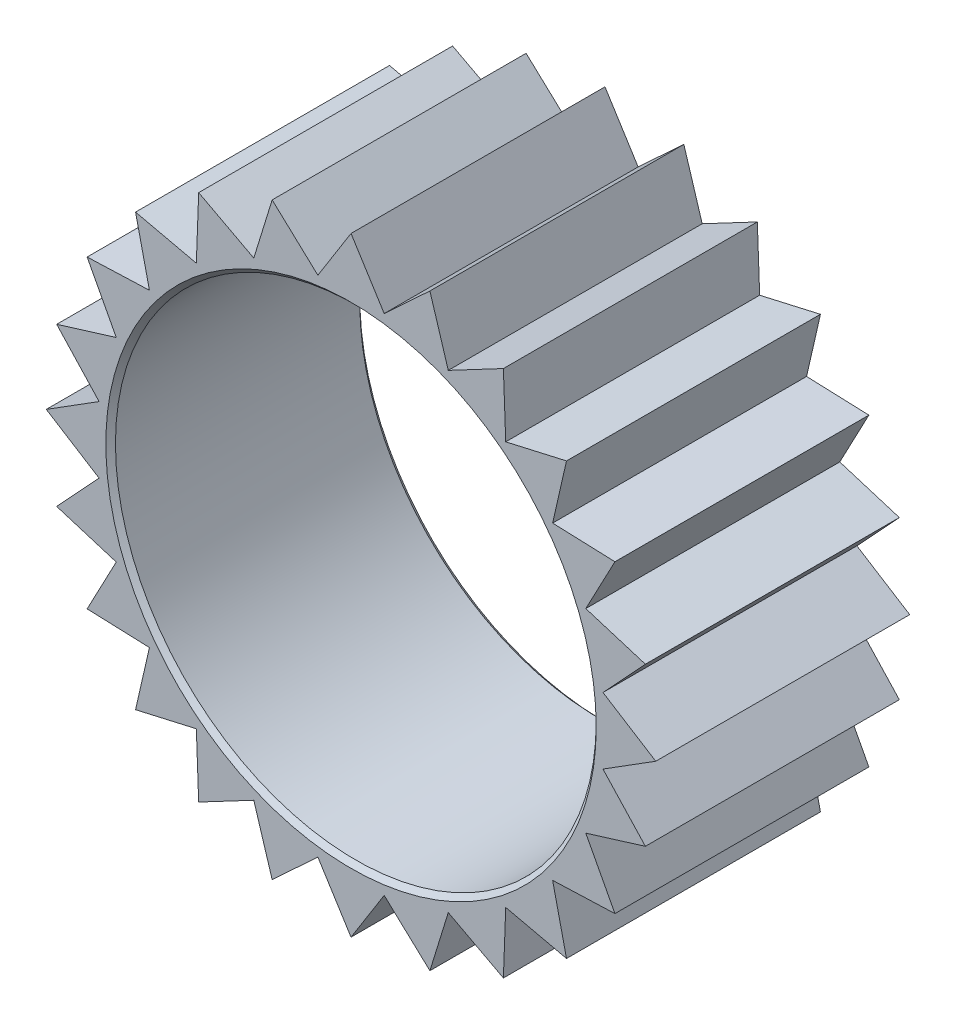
ISO-10303-21;
HEADER;
FILE_DESCRIPTION(('STEP AP214'),'2;1');
FILE_NAME('part.step','',(''),(''),'','','');
FILE_SCHEMA(('AUTOMOTIVE_DESIGN { 1 0 10303 214 1 1 1 1 }'));
ENDSEC;
DATA;
#1=APPLICATION_CONTEXT('core data for automotive mechanical design processes');
#2=APPLICATION_PROTOCOL_DEFINITION('international standard','automotive_design',2000,#1);
#3=PRODUCT_CONTEXT('',#1,'mechanical');
#4=PRODUCT('Part','Part','',(#3));
#5=PRODUCT_RELATED_PRODUCT_CATEGORY('part','',(#4));
#6=PRODUCT_DEFINITION_FORMATION('','',#4);
#7=PRODUCT_DEFINITION_CONTEXT('part definition',#1,'design');
#8=PRODUCT_DEFINITION('design','',#6,#7);
#9=PRODUCT_DEFINITION_SHAPE('','',#8);
#10=(LENGTH_UNIT() NAMED_UNIT(*) SI_UNIT(.MILLI.,.METRE.));
#11=(NAMED_UNIT(*) PLANE_ANGLE_UNIT() SI_UNIT($,.RADIAN.));
#12=(NAMED_UNIT(*) SI_UNIT($,.STERADIAN.) SOLID_ANGLE_UNIT());
#13=UNCERTAINTY_MEASURE_WITH_UNIT(LENGTH_MEASURE(1.E-05),#10,'distance_accuracy_value','');
#14=(GEOMETRIC_REPRESENTATION_CONTEXT(3) GLOBAL_UNCERTAINTY_ASSIGNED_CONTEXT((#13)) GLOBAL_UNIT_ASSIGNED_CONTEXT((#10,
#11,#12)) REPRESENTATION_CONTEXT('',''));
#15=CARTESIAN_POINT('',(0.,0.,0.));
#16=DIRECTION('',(0.,0.,1.));
#17=DIRECTION('',(1.,0.,0.));
#18=AXIS2_PLACEMENT_3D('',#15,#16,#17);
#19=CARTESIAN_POINT('',(0.,0.,-9.525));
#20=DIRECTION('',(0.,0.,1.));
#21=DIRECTION('',(1.,0.,0.));
#22=AXIS2_PLACEMENT_3D('',#19,#20,#21);
#23=PLANE('',#22);
#24=CARTESIAN_POINT('',(0.,0.,-9.525));
#25=DIRECTION('',(0.,0.,1.));
#26=DIRECTION('',(1.,0.,0.));
#27=AXIS2_PLACEMENT_3D('',#24,#25,#26);
#28=CIRCLE('',#27,9.19733999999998);
#29=CARTESIAN_POINT('',(9.19733999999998,0.,-9.525));
#30=VERTEX_POINT('',#29);
#31=EDGE_CURVE('E356',#30,#30,#28,.T.);
#32=ORIENTED_EDGE('',*,*,#31,.T.);
#33=EDGE_LOOP('',(#32));
#34=FACE_BOUND('',#33,.T.);
#35=DIRECTION('',(-0.531987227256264,0.846752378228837,0.));
#36=VECTOR('',#35,1.);
#37=CARTESIAN_POINT('',(0.,11.43,-9.525));
#38=LINE('',#37,#36);
#39=CARTESIAN_POINT('',(1.24409082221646,9.44980797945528,-9.525));
#40=VERTEX_POINT('',#39);
#41=CARTESIAN_POINT('',(0.,11.43,-9.525));
#42=VERTEX_POINT('',#41);
#43=EDGE_CURVE('E371',#40,#42,#38,.T.);
#44=ORIENTED_EDGE('',*,*,#43,.F.);
#45=DIRECTION('',(-0.733015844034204,-0.680211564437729,0.));
#46=VECTOR('',#45,1.);
#47=CARTESIAN_POINT('',(1.24409082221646,9.44980797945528,-9.525));
#48=LINE('',#47,#46);
#49=CARTESIAN_POINT('',(2.95830168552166,11.0405321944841,-9.525));
#50=VERTEX_POINT('',#49);
#51=EDGE_CURVE('E351',#50,#40,#48,.T.);
#52=ORIENTED_EDGE('',*,*,#51,.F.);
#53=DIRECTION('',(-0.294704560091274,0.955588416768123,0.));
#54=VECTOR('',#53,1.);
#55=CARTESIAN_POINT('',(2.95830168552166,11.0405321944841,-9.525));
#56=LINE('',#55,#54);
#57=CARTESIAN_POINT('',(3.64748973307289,8.8058191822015,-9.525));
#58=VERTEX_POINT('',#57);
#59=EDGE_CURVE('E771',#58,#50,#56,.T.);
#60=ORIENTED_EDGE('',*,*,#59,.F.);
#61=DIRECTION('',(-0.884090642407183,-0.467315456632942,0.));
#62=VECTOR('',#61,1.);
#63=CARTESIAN_POINT('',(3.64748973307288,8.8058191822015,-9.525));
#64=LINE('',#63,#62);
#65=CARTESIAN_POINT('',(5.71499999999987,9.8986703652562,-9.525));
#66=VERTEX_POINT('',#65);
#67=EDGE_CURVE('E760',#66,#58,#64,.T.);
#68=ORIENTED_EDGE('',*,*,#67,.F.);
#69=DIRECTION('',(-0.0373382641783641,0.999302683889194,0.));
#70=VECTOR('',#69,1.);
#71=CARTESIAN_POINT('',(5.71499999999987,9.8986703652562,-9.525));
#72=LINE('',#71,#70);
#73=CARTESIAN_POINT('',(5.80231824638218,7.56172835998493,-9.525));
#74=VERTEX_POINT('',#73);
#75=EDGE_CURVE('E365',#74,#66,#72,.T.);
#76=ORIENTED_EDGE('',*,*,#75,.F.);
#77=DIRECTION('',(-0.974916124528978,-0.222572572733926,0.));
#78=VECTOR('',#77,1.);
#79=CARTESIAN_POINT('',(5.80231824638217,7.56172835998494,-9.525));
#80=LINE('',#79,#78);
#81=CARTESIAN_POINT('',(8.08223050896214,8.08223050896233,-9.525));
#82=VERTEX_POINT('',#81);
#83=EDGE_CURVE('E745',#82,#74,#80,.T.);
#84=ORIENTED_EDGE('',*,*,#83,.F.);
#85=DIRECTION('',(0.222572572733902,0.974916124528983,0.));
#86=VECTOR('',#85,1.);
#87=CARTESIAN_POINT('',(8.08223050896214,8.08223050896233,-9.525));
#88=LINE('',#87,#86);
#89=CARTESIAN_POINT('',(7.5617283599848,5.80231824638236,-9.525));
#90=VERTEX_POINT('',#89);
#91=EDGE_CURVE('E740',#90,#82,#88,.T.);
#92=ORIENTED_EDGE('',*,*,#91,.F.);
#93=DIRECTION('',(-0.999302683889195,0.0373382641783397,0.));
#94=VECTOR('',#93,1.);
#95=CARTESIAN_POINT('',(7.56172835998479,5.80231824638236,-9.525));
#96=LINE('',#95,#94);
#97=CARTESIAN_POINT('',(9.89867036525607,5.71500000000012,-9.525));
#98=VERTEX_POINT('',#97);
#99=EDGE_CURVE('E728',#98,#90,#96,.T.);
#100=ORIENTED_EDGE('',*,*,#99,.F.);
#101=DIRECTION('',(0.46731545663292,0.884090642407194,0.));
#102=VECTOR('',#101,1.);
#103=CARTESIAN_POINT('',(9.89867036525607,5.71500000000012,-9.525));
#104=LINE('',#103,#102);
#105=CARTESIAN_POINT('',(8.80581918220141,3.64748973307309,-9.525));
#106=VERTEX_POINT('',#105);
#107=EDGE_CURVE('E723',#106,#98,#104,.T.);
#108=ORIENTED_EDGE('',*,*,#107,.F.);
#109=DIRECTION('',(-0.955588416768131,0.29470456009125,0.));
#110=VECTOR('',#109,1.);
#111=CARTESIAN_POINT('',(8.80581918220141,3.6474897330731,-9.525));
#112=LINE('',#111,#110);
#113=CARTESIAN_POINT('',(11.040532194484,2.95830168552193,-9.525));
#114=VERTEX_POINT('',#113);
#115=EDGE_CURVE('E711',#114,#106,#112,.T.);
#116=ORIENTED_EDGE('',*,*,#115,.F.);
#117=DIRECTION('',(0.680211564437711,0.733015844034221,0.));
#118=VECTOR('',#117,1.);
#119=CARTESIAN_POINT('',(11.040532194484,2.95830168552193,-9.525));
#120=LINE('',#119,#118);
#121=CARTESIAN_POINT('',(9.44980797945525,1.24409082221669,-9.525));
#122=VERTEX_POINT('',#121);
#123=EDGE_CURVE('E706',#122,#114,#120,.T.);
#124=ORIENTED_EDGE('',*,*,#123,.F.);
#125=DIRECTION('',(-0.846752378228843,0.531987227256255,0.));
#126=VECTOR('',#125,1.);
#127=CARTESIAN_POINT('',(9.44980797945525,1.24409082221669,-9.525));
#128=LINE('',#127,#126);
#129=CARTESIAN_POINT('',(11.43,1.19722895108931E-13,-9.525));
#130=VERTEX_POINT('',#129);
#131=EDGE_CURVE('E694',#130,#122,#128,.T.);
#132=ORIENTED_EDGE('',*,*,#131,.F.);
#133=DIRECTION('',(0.846752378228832,0.531987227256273,0.));
#134=VECTOR('',#133,1.);
#135=CARTESIAN_POINT('',(11.43,1.19722895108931E-13,-9.525));
#136=LINE('',#135,#134);
#137=CARTESIAN_POINT('',(9.44980797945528,-1.2440908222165,-9.525));
#138=VERTEX_POINT('',#137);
#139=EDGE_CURVE('E689',#138,#130,#136,.T.);
#140=ORIENTED_EDGE('',*,*,#139,.F.);
#141=DIRECTION('',(-0.680211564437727,0.733015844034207,0.));
#142=VECTOR('',#141,1.);
#143=CARTESIAN_POINT('',(9.44980797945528,-1.24409082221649,-9.525));
#144=LINE('',#143,#142);
#145=CARTESIAN_POINT('',(11.0405321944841,-2.9583016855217,-9.525));
#146=VERTEX_POINT('',#145);
#147=EDGE_CURVE('E677',#146,#138,#144,.T.);
#148=ORIENTED_EDGE('',*,*,#147,.F.);
#149=DIRECTION('',(0.955588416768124,0.29470456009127,0.));
#150=VECTOR('',#149,1.);
#151=CARTESIAN_POINT('',(11.0405321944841,-2.9583016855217,-9.525));
#152=LINE('',#151,#150);
#153=CARTESIAN_POINT('',(8.80581918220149,-3.64748973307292,-9.525));
#154=VERTEX_POINT('',#153);
#155=EDGE_CURVE('E672',#154,#146,#152,.T.);
#156=ORIENTED_EDGE('',*,*,#155,.F.);
#157=DIRECTION('',(-0.467315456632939,0.884090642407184,0.));
#158=VECTOR('',#157,1.);
#159=CARTESIAN_POINT('',(8.80581918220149,-3.64748973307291,-9.525));
#160=LINE('',#159,#158);
#161=CARTESIAN_POINT('',(9.89867036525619,-5.71499999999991,-9.525));
#162=VERTEX_POINT('',#161);
#163=EDGE_CURVE('E660',#162,#154,#160,.T.);
#164=ORIENTED_EDGE('',*,*,#163,.F.);
#165=DIRECTION('',(0.999302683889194,0.0373382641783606,0.));
#166=VECTOR('',#165,1.);
#167=CARTESIAN_POINT('',(9.89867036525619,-5.71499999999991,-9.525));
#168=LINE('',#167,#166);
#169=CARTESIAN_POINT('',(7.56172835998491,-5.8023182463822,-9.525));
#170=VERTEX_POINT('',#169);
#171=EDGE_CURVE('E655',#170,#162,#168,.T.);
#172=ORIENTED_EDGE('',*,*,#171,.F.);
#173=DIRECTION('',(-0.222572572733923,0.974916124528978,0.));
#174=VECTOR('',#173,1.);
#175=CARTESIAN_POINT('',(7.56172835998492,-5.8023182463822,-9.525));
#176=LINE('',#175,#174);
#177=CARTESIAN_POINT('',(8.08223050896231,-8.08223050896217,-9.525));
#178=VERTEX_POINT('',#177);
#179=EDGE_CURVE('E643',#178,#170,#176,.T.);
#180=ORIENTED_EDGE('',*,*,#179,.F.);
#181=DIRECTION('',(0.974916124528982,-0.222572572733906,0.));
#182=VECTOR('',#181,1.);
#183=CARTESIAN_POINT('',(8.08223050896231,-8.08223050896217,-9.525));
#184=LINE('',#183,#182);
#185=CARTESIAN_POINT('',(5.80231824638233,-7.56172835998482,-9.525));
#186=VERTEX_POINT('',#185);
#187=EDGE_CURVE('E638',#186,#178,#184,.T.);
#188=ORIENTED_EDGE('',*,*,#187,.F.);
#189=DIRECTION('',(0.0373382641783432,0.999302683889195,0.));
#190=VECTOR('',#189,1.);
#191=CARTESIAN_POINT('',(5.80231824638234,-7.56172835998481,-9.525));
#192=LINE('',#191,#190);
#193=CARTESIAN_POINT('',(5.71500000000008,-9.89867036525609,-9.525));
#194=VERTEX_POINT('',#193);
#195=EDGE_CURVE('E626',#194,#186,#192,.T.);
#196=ORIENTED_EDGE('',*,*,#195,.F.);
#197=DIRECTION('',(0.884090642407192,-0.467315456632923,0.));
#198=VECTOR('',#197,1.);
#199=CARTESIAN_POINT('',(5.71500000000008,-9.89867036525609,-9.525));
#200=LINE('',#199,#198);
#201=CARTESIAN_POINT('',(3.64748973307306,-8.80581918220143,-9.525));
#202=VERTEX_POINT('',#201);
#203=EDGE_CURVE('E621',#202,#194,#200,.T.);
#204=ORIENTED_EDGE('',*,*,#203,.F.);
#205=DIRECTION('',(0.294704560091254,0.95558841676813,0.));
#206=VECTOR('',#205,1.);
#207=CARTESIAN_POINT('',(3.64748973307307,-8.80581918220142,-9.525));
#208=LINE('',#207,#206);
#209=CARTESIAN_POINT('',(2.9583016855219,-11.040532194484,-9.525));
#210=VERTEX_POINT('',#209);
#211=EDGE_CURVE('E609',#210,#202,#208,.T.);
#212=ORIENTED_EDGE('',*,*,#211,.F.);
#213=DIRECTION('',(0.733015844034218,-0.680211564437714,0.));
#214=VECTOR('',#213,1.);
#215=CARTESIAN_POINT('',(2.9583016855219,-11.040532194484,-9.525));
#216=LINE('',#215,#214);
#217=CARTESIAN_POINT('',(1.24409082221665,-9.44980797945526,-9.525));
#218=VERTEX_POINT('',#217);
#219=EDGE_CURVE('E604',#218,#210,#216,.T.);
#220=ORIENTED_EDGE('',*,*,#219,.F.);
#221=DIRECTION('',(0.531987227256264,0.846752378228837,0.));
#222=VECTOR('',#221,1.);
#223=CARTESIAN_POINT('',(1.2440908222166,-9.44980797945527,-9.525));
#224=LINE('',#223,#222);
#225=CARTESIAN_POINT('',(0.,-11.43,-9.525));
#226=VERTEX_POINT('',#225);
#227=EDGE_CURVE('E592',#226,#218,#224,.T.);
#228=ORIENTED_EDGE('',*,*,#227,.F.);
#229=DIRECTION('',(0.531987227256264,-0.846752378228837,0.));
#230=VECTOR('',#229,1.);
#231=CARTESIAN_POINT('',(0.,-11.43,-9.525));
#232=LINE('',#231,#230);
#233=CARTESIAN_POINT('',(-1.2440908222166,-9.44980797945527,-9.525));
#234=VERTEX_POINT('',#233);
#235=EDGE_CURVE('E587',#234,#226,#232,.T.);
#236=ORIENTED_EDGE('',*,*,#235,.F.);
#237=DIRECTION('',(0.733015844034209,0.680211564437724,0.));
#238=VECTOR('',#237,1.);
#239=CARTESIAN_POINT('',(-1.24409082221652,-9.44980797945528,-9.525));
#240=LINE('',#239,#238);
#241=CARTESIAN_POINT('',(-2.95830168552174,-11.0405321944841,-9.525));
#242=VERTEX_POINT('',#241);
#243=EDGE_CURVE('E575',#242,#234,#240,.T.);
#244=ORIENTED_EDGE('',*,*,#243,.F.);
#245=DIRECTION('',(0.294704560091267,-0.955588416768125,0.));
#246=VECTOR('',#245,1.);
#247=CARTESIAN_POINT('',(-2.95830168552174,-11.0405321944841,-9.525));
#248=LINE('',#247,#246);
#249=CARTESIAN_POINT('',(-3.64748973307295,-8.80581918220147,-9.525));
#250=VERTEX_POINT('',#249);
#251=EDGE_CURVE('E570',#250,#242,#248,.T.);
#252=ORIENTED_EDGE('',*,*,#251,.F.);
#253=DIRECTION('',(0.884090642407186,0.467315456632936,0.));
#254=VECTOR('',#253,1.);
#255=CARTESIAN_POINT('',(-3.64748973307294,-8.80581918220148,-9.525));
#256=LINE('',#255,#254);
#257=CARTESIAN_POINT('',(-5.71499999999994,-9.89867036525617,-9.525));
#258=VERTEX_POINT('',#257);
#259=EDGE_CURVE('E558',#258,#250,#256,.T.);
#260=ORIENTED_EDGE('',*,*,#259,.F.);
#261=DIRECTION('',(0.0373382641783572,-0.999302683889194,0.));
#262=VECTOR('',#261,1.);
#263=CARTESIAN_POINT('',(-5.71499999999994,-9.89867036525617,-9.525));
#264=LINE('',#263,#262);
#265=CARTESIAN_POINT('',(-5.80231824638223,-7.56172835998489,-9.525));
#266=VERTEX_POINT('',#265);
#267=EDGE_CURVE('E553',#266,#258,#264,.T.);
#268=ORIENTED_EDGE('',*,*,#267,.F.);
#269=DIRECTION('',(0.974916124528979,0.222572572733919,0.));
#270=VECTOR('',#269,1.);
#271=CARTESIAN_POINT('',(-5.80231824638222,-7.5617283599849,-9.525));
#272=LINE('',#271,#270);
#273=CARTESIAN_POINT('',(-8.08223050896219,-8.08223050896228,-9.525));
#274=VERTEX_POINT('',#273);
#275=EDGE_CURVE('E541',#274,#266,#272,.T.);
#276=ORIENTED_EDGE('',*,*,#275,.F.);
#277=DIRECTION('',(-0.222572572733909,-0.974916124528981,0.));
#278=VECTOR('',#277,1.);
#279=CARTESIAN_POINT('',(-8.08223050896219,-8.08223050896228,-9.525));
#280=LINE('',#279,#278);
#281=CARTESIAN_POINT('',(-7.56172835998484,-5.8023182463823,-9.525));
#282=VERTEX_POINT('',#281);
#283=EDGE_CURVE('E536',#282,#274,#280,.T.);
#284=ORIENTED_EDGE('',*,*,#283,.F.);
#285=DIRECTION('',(0.999302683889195,-0.0373382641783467,0.));
#286=VECTOR('',#285,1.);
#287=CARTESIAN_POINT('',(-7.56172835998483,-5.80231824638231,-9.525));
#288=LINE('',#287,#286);
#289=CARTESIAN_POINT('',(-9.89867036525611,-5.71500000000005,-9.525));
#290=VERTEX_POINT('',#289);
#291=EDGE_CURVE('E524',#290,#282,#288,.T.);
#292=ORIENTED_EDGE('',*,*,#291,.F.);
#293=DIRECTION('',(-0.467315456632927,-0.884090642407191,0.));
#294=VECTOR('',#293,1.);
#295=CARTESIAN_POINT('',(-9.89867036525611,-5.71500000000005,-9.525));
#296=LINE('',#295,#294);
#297=CARTESIAN_POINT('',(-8.80581918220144,-3.64748973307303,-9.525));
#298=VERTEX_POINT('',#297);
#299=EDGE_CURVE('E519',#298,#290,#296,.T.);
#300=ORIENTED_EDGE('',*,*,#299,.F.);
#301=DIRECTION('',(0.955588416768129,-0.294704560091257,0.));
#302=VECTOR('',#301,1.);
#303=CARTESIAN_POINT('',(-8.80581918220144,-3.64748973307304,-9.525));
#304=LINE('',#303,#302);
#305=CARTESIAN_POINT('',(-11.040532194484,-2.95830168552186,-9.525));
#306=VERTEX_POINT('',#305);
#307=EDGE_CURVE('E507',#306,#298,#304,.T.);
#308=ORIENTED_EDGE('',*,*,#307,.F.);
#309=DIRECTION('',(-0.680211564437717,-0.733015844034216,0.));
#310=VECTOR('',#309,1.);
#311=CARTESIAN_POINT('',(-11.040532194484,-2.95830168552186,-9.525));
#312=LINE('',#311,#310);
#313=CARTESIAN_POINT('',(-9.44980797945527,-1.24409082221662,-9.525));
#314=VERTEX_POINT('',#313);
#315=EDGE_CURVE('E502',#314,#306,#312,.T.);
#316=ORIENTED_EDGE('',*,*,#315,.F.);
#317=DIRECTION('',(0.846752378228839,-0.531987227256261,0.));
#318=VECTOR('',#317,1.);
#319=CARTESIAN_POINT('',(-9.44980797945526,-1.24409082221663,-9.525));
#320=LINE('',#319,#318);
#321=CARTESIAN_POINT('',(-11.43,0.,-9.525));
#322=VERTEX_POINT('',#321);
#323=EDGE_CURVE('E490',#322,#314,#320,.T.);
#324=ORIENTED_EDGE('',*,*,#323,.F.);
#325=DIRECTION('',(-0.846752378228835,-0.531987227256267,0.));
#326=VECTOR('',#325,1.);
#327=CARTESIAN_POINT('',(-11.43,0.,-9.525));
#328=LINE('',#327,#326);
#329=CARTESIAN_POINT('',(-9.44980797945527,1.24409082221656,-9.525));
#330=VERTEX_POINT('',#329);
#331=EDGE_CURVE('E485',#330,#322,#328,.T.);
#332=ORIENTED_EDGE('',*,*,#331,.F.);
#333=DIRECTION('',(0.680211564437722,-0.733015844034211,0.));
#334=VECTOR('',#333,1.);
#335=CARTESIAN_POINT('',(-9.44980797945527,1.24409082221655,-9.525));
#336=LINE('',#335,#334);
#337=CARTESIAN_POINT('',(-11.0405321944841,2.95830168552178,-9.525));
#338=VERTEX_POINT('',#337);
#339=EDGE_CURVE('E473',#338,#330,#336,.T.);
#340=ORIENTED_EDGE('',*,*,#339,.F.);
#341=DIRECTION('',(-0.955588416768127,-0.294704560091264,0.));
#342=VECTOR('',#341,1.);
#343=CARTESIAN_POINT('',(-11.0405321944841,2.95830168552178,-9.525));
#344=LINE('',#343,#342);
#345=CARTESIAN_POINT('',(-8.80581918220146,3.64748973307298,-9.525));
#346=VERTEX_POINT('',#345);
#347=EDGE_CURVE('E468',#346,#338,#344,.T.);
#348=ORIENTED_EDGE('',*,*,#347,.F.);
#349=DIRECTION('',(0.467315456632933,-0.884090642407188,0.));
#350=VECTOR('',#349,1.);
#351=CARTESIAN_POINT('',(-8.80581918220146,3.64748973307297,-9.525));
#352=LINE('',#351,#350);
#353=CARTESIAN_POINT('',(-9.89867036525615,5.71499999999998,-9.525));
#354=VERTEX_POINT('',#353);
#355=EDGE_CURVE('E456',#354,#346,#352,.T.);
#356=ORIENTED_EDGE('',*,*,#355,.F.);
#357=DIRECTION('',(-0.999302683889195,-0.0373382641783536,0.));
#358=VECTOR('',#357,1.);
#359=CARTESIAN_POINT('',(-9.89867036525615,5.71499999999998,-9.525));
#360=LINE('',#359,#358);
#361=CARTESIAN_POINT('',(-7.56172835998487,5.80231824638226,-9.525));
#362=VERTEX_POINT('',#361);
#363=EDGE_CURVE('E451',#362,#354,#360,.T.);
#364=ORIENTED_EDGE('',*,*,#363,.F.);
#365=DIRECTION('',(0.222572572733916,-0.97491612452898,0.));
#366=VECTOR('',#365,1.);
#367=CARTESIAN_POINT('',(-7.56172835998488,5.80231824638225,-9.525));
#368=LINE('',#367,#366);
#369=CARTESIAN_POINT('',(-8.08223050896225,8.08223050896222,-9.525));
#370=VERTEX_POINT('',#369);
#371=EDGE_CURVE('E439',#370,#362,#368,.T.);
#372=ORIENTED_EDGE('',*,*,#371,.F.);
#373=DIRECTION('',(-0.974916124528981,0.222572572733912,0.));
#374=VECTOR('',#373,1.);
#375=CARTESIAN_POINT('',(-8.08223050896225,8.08223050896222,-9.525));
#376=LINE('',#375,#374);
#377=CARTESIAN_POINT('',(-5.80231824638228,7.56172835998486,-9.525));
#378=VERTEX_POINT('',#377);
#379=EDGE_CURVE('E434',#378,#370,#376,.T.);
#380=ORIENTED_EDGE('',*,*,#379,.F.);
#381=DIRECTION('',(-0.0373382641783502,-0.999302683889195,0.));
#382=VECTOR('',#381,1.);
#383=CARTESIAN_POINT('',(-5.80231824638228,7.56172835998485,-9.525));
#384=LINE('',#383,#382);
#385=CARTESIAN_POINT('',(-5.71500000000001,9.89867036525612,-9.525));
#386=VERTEX_POINT('',#385);
#387=EDGE_CURVE('E422',#386,#378,#384,.T.);
#388=ORIENTED_EDGE('',*,*,#387,.F.);
#389=DIRECTION('',(-0.884090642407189,0.46731545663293,0.));
#390=VECTOR('',#389,1.);
#391=CARTESIAN_POINT('',(-5.71500000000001,9.89867036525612,-9.525));
#392=LINE('',#391,#390);
#393=CARTESIAN_POINT('',(-3.647489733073,8.80581918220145,-9.525));
#394=VERTEX_POINT('',#393);
#395=EDGE_CURVE('E417',#394,#386,#392,.T.);
#396=ORIENTED_EDGE('',*,*,#395,.F.);
#397=DIRECTION('',(-0.29470456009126,-0.955588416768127,0.));
#398=VECTOR('',#397,1.);
#399=CARTESIAN_POINT('',(-3.64748973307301,8.80581918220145,-9.525));
#400=LINE('',#399,#398);
#401=CARTESIAN_POINT('',(-2.95830168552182,11.040532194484,-9.525));
#402=VERTEX_POINT('',#401);
#403=EDGE_CURVE('E405',#402,#394,#400,.T.);
#404=ORIENTED_EDGE('',*,*,#403,.F.);
#405=DIRECTION('',(-0.733015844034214,0.680211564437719,0.));
#406=VECTOR('',#405,1.);
#407=CARTESIAN_POINT('',(-2.95830168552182,11.040532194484,-9.525));
#408=LINE('',#407,#406);
#409=CARTESIAN_POINT('',(-1.24409082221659,9.44980797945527,-9.525));
#410=VERTEX_POINT('',#409);
#411=EDGE_CURVE('E410',#410,#402,#408,.T.);
#412=ORIENTED_EDGE('',*,*,#411,.F.);
#413=DIRECTION('',(-0.531987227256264,-0.846752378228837,0.));
#414=VECTOR('',#413,1.);
#415=CARTESIAN_POINT('',(-1.2440908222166,9.44980797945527,-9.525));
#416=LINE('',#415,#414);
#417=EDGE_CURVE('E377',#42,#410,#416,.T.);
#418=ORIENTED_EDGE('',*,*,#417,.F.);
#419=EDGE_LOOP('',(#44,#52,#60,#68,#76,#84,#92,#100,#108,#116,#124,#132,#140,#148,#156,#164,
#172,#180,#188,#196,#204,#212,#220,#228,#236,#244,#252,#260,#268,#276,#284,#292,#300,#308,#316,
#324,#332,#340,#348,#356,#364,#372,#380,#388,#396,#404,#412,#418));
#420=FACE_BOUND('',#419,.T.);
#421=ADVANCED_FACE('F39',(#34,#420),#23,.F.);
#422=CARTESIAN_POINT('',(0.,0.,0.));
#423=DIRECTION('',(0.,0.,1.));
#424=DIRECTION('',(1.,0.,0.));
#425=AXIS2_PLACEMENT_3D('',#422,#423,#424);
#426=PLANE('',#425);
#427=CARTESIAN_POINT('',(0.,0.,0.));
#428=DIRECTION('',(0.,0.,1.));
#429=DIRECTION('',(1.,0.,0.));
#430=AXIS2_PLACEMENT_3D('',#427,#428,#429);
#431=CIRCLE('',#430,9.19734000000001);
#432=CARTESIAN_POINT('',(9.19734000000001,0.,0.));
#433=VERTEX_POINT('',#432);
#434=EDGE_CURVE('E11',#433,#433,#431,.F.);
#435=ORIENTED_EDGE('',*,*,#434,.T.);
#436=EDGE_LOOP('',(#435));
#437=FACE_BOUND('',#436,.T.);
#438=DIRECTION('',(-0.531987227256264,-0.846752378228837,0.));
#439=VECTOR('',#438,1.);
#440=CARTESIAN_POINT('',(-1.2440908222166,9.44980797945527,0.));
#441=LINE('',#440,#439);
#442=CARTESIAN_POINT('',(0.,11.43,0.));
#443=VERTEX_POINT('',#442);
#444=CARTESIAN_POINT('',(-1.2440908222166,9.44980797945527,0.));
#445=VERTEX_POINT('',#444);
#446=EDGE_CURVE('E368',#443,#445,#441,.T.);
#447=ORIENTED_EDGE('',*,*,#446,.T.);
#448=DIRECTION('',(-0.733015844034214,0.680211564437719,0.));
#449=VECTOR('',#448,1.);
#450=CARTESIAN_POINT('',(-2.95830168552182,11.040532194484,0.));
#451=LINE('',#450,#449);
#452=CARTESIAN_POINT('',(-2.95830168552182,11.040532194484,0.));
#453=VERTEX_POINT('',#452);
#454=EDGE_CURVE('E54',#445,#453,#451,.T.);
#455=ORIENTED_EDGE('',*,*,#454,.T.);
#456=DIRECTION('',(-0.29470456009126,-0.955588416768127,0.));
#457=VECTOR('',#456,1.);
#458=CARTESIAN_POINT('',(-3.64748973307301,8.80581918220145,0.));
#459=LINE('',#458,#457);
#460=CARTESIAN_POINT('',(-3.64748973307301,8.80581918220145,0.));
#461=VERTEX_POINT('',#460);
#462=EDGE_CURVE('E407',#453,#461,#459,.T.);
#463=ORIENTED_EDGE('',*,*,#462,.T.);
#464=DIRECTION('',(-0.884090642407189,0.46731545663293,0.));
#465=VECTOR('',#464,1.);
#466=CARTESIAN_POINT('',(-5.71500000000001,9.89867036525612,0.));
#467=LINE('',#466,#465);
#468=CARTESIAN_POINT('',(-5.71500000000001,9.89867036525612,0.));
#469=VERTEX_POINT('',#468);
#470=EDGE_CURVE('E426',#461,#469,#467,.T.);
#471=ORIENTED_EDGE('',*,*,#470,.T.);
#472=DIRECTION('',(-0.0373382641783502,-0.999302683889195,0.));
#473=VECTOR('',#472,1.);
#474=CARTESIAN_POINT('',(-5.80231824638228,7.56172835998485,0.));
#475=LINE('',#474,#473);
#476=CARTESIAN_POINT('',(-5.80231824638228,7.56172835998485,0.));
#477=VERTEX_POINT('',#476);
#478=EDGE_CURVE('E412',#469,#477,#475,.T.);
#479=ORIENTED_EDGE('',*,*,#478,.T.);
#480=DIRECTION('',(-0.974916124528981,0.222572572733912,0.));
#481=VECTOR('',#480,1.);
#482=CARTESIAN_POINT('',(-8.08223050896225,8.08223050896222,0.));
#483=LINE('',#482,#481);
#484=CARTESIAN_POINT('',(-8.08223050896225,8.08223050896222,0.));
#485=VERTEX_POINT('',#484);
#486=EDGE_CURVE('E443',#477,#485,#483,.T.);
#487=ORIENTED_EDGE('',*,*,#486,.T.);
#488=DIRECTION('',(0.222572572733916,-0.97491612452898,0.));
#489=VECTOR('',#488,1.);
#490=CARTESIAN_POINT('',(-7.56172835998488,5.80231824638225,0.));
#491=LINE('',#490,#489);
#492=CARTESIAN_POINT('',(-7.56172835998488,5.80231824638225,0.));
#493=VERTEX_POINT('',#492);
#494=EDGE_CURVE('E421',#485,#493,#491,.T.);
#495=ORIENTED_EDGE('',*,*,#494,.T.);
#496=DIRECTION('',(-0.999302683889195,-0.0373382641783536,0.));
#497=VECTOR('',#496,1.);
#498=CARTESIAN_POINT('',(-9.89867036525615,5.71499999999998,0.));
#499=LINE('',#498,#497);
#500=CARTESIAN_POINT('',(-9.89867036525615,5.71499999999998,0.));
#501=VERTEX_POINT('',#500);
#502=EDGE_CURVE('E460',#493,#501,#499,.T.);
#503=ORIENTED_EDGE('',*,*,#502,.T.);
#504=DIRECTION('',(0.467315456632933,-0.884090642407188,0.));
#505=VECTOR('',#504,1.);
#506=CARTESIAN_POINT('',(-8.80581918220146,3.64748973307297,0.));
#507=LINE('',#506,#505);
#508=CARTESIAN_POINT('',(-8.80581918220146,3.64748973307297,0.));
#509=VERTEX_POINT('',#508);
#510=EDGE_CURVE('E438',#501,#509,#507,.T.);
#511=ORIENTED_EDGE('',*,*,#510,.T.);
#512=DIRECTION('',(-0.955588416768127,-0.294704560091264,0.));
#513=VECTOR('',#512,1.);
#514=CARTESIAN_POINT('',(-11.0405321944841,2.95830168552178,0.));
#515=LINE('',#514,#513);
#516=CARTESIAN_POINT('',(-11.0405321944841,2.95830168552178,0.));
#517=VERTEX_POINT('',#516);
#518=EDGE_CURVE('E477',#509,#517,#515,.T.);
#519=ORIENTED_EDGE('',*,*,#518,.T.);
#520=DIRECTION('',(0.680211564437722,-0.733015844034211,0.));
#521=VECTOR('',#520,1.);
#522=CARTESIAN_POINT('',(-9.44980797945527,1.24409082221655,0.));
#523=LINE('',#522,#521);
#524=CARTESIAN_POINT('',(-9.44980797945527,1.24409082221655,0.));
#525=VERTEX_POINT('',#524);
#526=EDGE_CURVE('E455',#517,#525,#523,.T.);
#527=ORIENTED_EDGE('',*,*,#526,.T.);
#528=DIRECTION('',(-0.846752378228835,-0.531987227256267,0.));
#529=VECTOR('',#528,1.);
#530=CARTESIAN_POINT('',(-11.43,0.,0.));
#531=LINE('',#530,#529);
#532=CARTESIAN_POINT('',(-11.43,0.,0.));
#533=VERTEX_POINT('',#532);
#534=EDGE_CURVE('E494',#525,#533,#531,.T.);
#535=ORIENTED_EDGE('',*,*,#534,.T.);
#536=DIRECTION('',(0.846752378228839,-0.531987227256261,0.));
#537=VECTOR('',#536,1.);
#538=CARTESIAN_POINT('',(-9.44980797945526,-1.24409082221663,0.));
#539=LINE('',#538,#537);
#540=CARTESIAN_POINT('',(-9.44980797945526,-1.24409082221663,0.));
#541=VERTEX_POINT('',#540);
#542=EDGE_CURVE('E472',#533,#541,#539,.T.);
#543=ORIENTED_EDGE('',*,*,#542,.T.);
#544=DIRECTION('',(-0.680211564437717,-0.733015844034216,0.));
#545=VECTOR('',#544,1.);
#546=CARTESIAN_POINT('',(-11.040532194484,-2.95830168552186,0.));
#547=LINE('',#546,#545);
#548=CARTESIAN_POINT('',(-11.040532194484,-2.95830168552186,0.));
#549=VERTEX_POINT('',#548);
#550=EDGE_CURVE('E511',#541,#549,#547,.T.);
#551=ORIENTED_EDGE('',*,*,#550,.T.);
#552=DIRECTION('',(0.955588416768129,-0.294704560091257,0.));
#553=VECTOR('',#552,1.);
#554=CARTESIAN_POINT('',(-8.80581918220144,-3.64748973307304,0.));
#555=LINE('',#554,#553);
#556=CARTESIAN_POINT('',(-8.80581918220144,-3.64748973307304,0.));
#557=VERTEX_POINT('',#556);
#558=EDGE_CURVE('E489',#549,#557,#555,.T.);
#559=ORIENTED_EDGE('',*,*,#558,.T.);
#560=DIRECTION('',(-0.467315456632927,-0.884090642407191,0.));
#561=VECTOR('',#560,1.);
#562=CARTESIAN_POINT('',(-9.89867036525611,-5.71500000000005,0.));
#563=LINE('',#562,#561);
#564=CARTESIAN_POINT('',(-9.89867036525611,-5.71500000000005,0.));
#565=VERTEX_POINT('',#564);
#566=EDGE_CURVE('E528',#557,#565,#563,.T.);
#567=ORIENTED_EDGE('',*,*,#566,.T.);
#568=DIRECTION('',(0.999302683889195,-0.0373382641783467,0.));
#569=VECTOR('',#568,1.);
#570=CARTESIAN_POINT('',(-7.56172835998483,-5.80231824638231,0.));
#571=LINE('',#570,#569);
#572=CARTESIAN_POINT('',(-7.56172835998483,-5.80231824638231,0.));
#573=VERTEX_POINT('',#572);
#574=EDGE_CURVE('E506',#565,#573,#571,.T.);
#575=ORIENTED_EDGE('',*,*,#574,.T.);
#576=DIRECTION('',(-0.222572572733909,-0.974916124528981,0.));
#577=VECTOR('',#576,1.);
#578=CARTESIAN_POINT('',(-8.08223050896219,-8.08223050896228,0.));
#579=LINE('',#578,#577);
#580=CARTESIAN_POINT('',(-8.08223050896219,-8.08223050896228,0.));
#581=VERTEX_POINT('',#580);
#582=EDGE_CURVE('E545',#573,#581,#579,.T.);
#583=ORIENTED_EDGE('',*,*,#582,.T.);
#584=DIRECTION('',(0.974916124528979,0.222572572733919,0.));
#585=VECTOR('',#584,1.);
#586=CARTESIAN_POINT('',(-5.80231824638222,-7.5617283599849,0.));
#587=LINE('',#586,#585);
#588=CARTESIAN_POINT('',(-5.80231824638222,-7.5617283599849,0.));
#589=VERTEX_POINT('',#588);
#590=EDGE_CURVE('E523',#581,#589,#587,.T.);
#591=ORIENTED_EDGE('',*,*,#590,.T.);
#592=DIRECTION('',(0.0373382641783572,-0.999302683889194,0.));
#593=VECTOR('',#592,1.);
#594=CARTESIAN_POINT('',(-5.71499999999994,-9.89867036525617,0.));
#595=LINE('',#594,#593);
#596=CARTESIAN_POINT('',(-5.71499999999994,-9.89867036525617,0.));
#597=VERTEX_POINT('',#596);
#598=EDGE_CURVE('E562',#589,#597,#595,.T.);
#599=ORIENTED_EDGE('',*,*,#598,.T.);
#600=DIRECTION('',(0.884090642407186,0.467315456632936,0.));
#601=VECTOR('',#600,1.);
#602=CARTESIAN_POINT('',(-3.64748973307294,-8.80581918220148,0.));
#603=LINE('',#602,#601);
#604=CARTESIAN_POINT('',(-3.64748973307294,-8.80581918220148,0.));
#605=VERTEX_POINT('',#604);
#606=EDGE_CURVE('E540',#597,#605,#603,.T.);
#607=ORIENTED_EDGE('',*,*,#606,.T.);
#608=DIRECTION('',(0.294704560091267,-0.955588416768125,0.));
#609=VECTOR('',#608,1.);
#610=CARTESIAN_POINT('',(-2.95830168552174,-11.0405321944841,0.));
#611=LINE('',#610,#609);
#612=CARTESIAN_POINT('',(-2.95830168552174,-11.0405321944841,0.));
#613=VERTEX_POINT('',#612);
#614=EDGE_CURVE('E579',#605,#613,#611,.T.);
#615=ORIENTED_EDGE('',*,*,#614,.T.);
#616=DIRECTION('',(0.733015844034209,0.680211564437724,0.));
#617=VECTOR('',#616,1.);
#618=CARTESIAN_POINT('',(-1.24409082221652,-9.44980797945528,0.));
#619=LINE('',#618,#617);
#620=CARTESIAN_POINT('',(-1.24409082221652,-9.44980797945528,0.));
#621=VERTEX_POINT('',#620);
#622=EDGE_CURVE('E557',#613,#621,#619,.T.);
#623=ORIENTED_EDGE('',*,*,#622,.T.);
#624=DIRECTION('',(0.531987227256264,-0.846752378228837,0.));
#625=VECTOR('',#624,1.);
#626=CARTESIAN_POINT('',(0.,-11.43,0.));
#627=LINE('',#626,#625);
#628=CARTESIAN_POINT('',(0.,-11.43,0.));
#629=VERTEX_POINT('',#628);
#630=EDGE_CURVE('E596',#621,#629,#627,.T.);
#631=ORIENTED_EDGE('',*,*,#630,.T.);
#632=DIRECTION('',(0.531987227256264,0.846752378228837,0.));
#633=VECTOR('',#632,1.);
#634=CARTESIAN_POINT('',(1.2440908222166,-9.44980797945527,0.));
#635=LINE('',#634,#633);
#636=CARTESIAN_POINT('',(1.2440908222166,-9.44980797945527,0.));
#637=VERTEX_POINT('',#636);
#638=EDGE_CURVE('E574',#629,#637,#635,.T.);
#639=ORIENTED_EDGE('',*,*,#638,.T.);
#640=DIRECTION('',(0.733015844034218,-0.680211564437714,0.));
#641=VECTOR('',#640,1.);
#642=CARTESIAN_POINT('',(2.9583016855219,-11.040532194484,0.));
#643=LINE('',#642,#641);
#644=CARTESIAN_POINT('',(2.9583016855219,-11.040532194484,0.));
#645=VERTEX_POINT('',#644);
#646=EDGE_CURVE('E613',#637,#645,#643,.T.);
#647=ORIENTED_EDGE('',*,*,#646,.T.);
#648=DIRECTION('',(0.294704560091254,0.95558841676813,0.));
#649=VECTOR('',#648,1.);
#650=CARTESIAN_POINT('',(3.64748973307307,-8.80581918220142,0.));
#651=LINE('',#650,#649);
#652=CARTESIAN_POINT('',(3.64748973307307,-8.80581918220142,0.));
#653=VERTEX_POINT('',#652);
#654=EDGE_CURVE('E591',#645,#653,#651,.T.);
#655=ORIENTED_EDGE('',*,*,#654,.T.);
#656=DIRECTION('',(0.884090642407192,-0.467315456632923,0.));
#657=VECTOR('',#656,1.);
#658=CARTESIAN_POINT('',(5.71500000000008,-9.89867036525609,0.));
#659=LINE('',#658,#657);
#660=CARTESIAN_POINT('',(5.71500000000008,-9.89867036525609,0.));
#661=VERTEX_POINT('',#660);
#662=EDGE_CURVE('E630',#653,#661,#659,.T.);
#663=ORIENTED_EDGE('',*,*,#662,.T.);
#664=DIRECTION('',(0.0373382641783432,0.999302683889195,0.));
#665=VECTOR('',#664,1.);
#666=CARTESIAN_POINT('',(5.80231824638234,-7.56172835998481,0.));
#667=LINE('',#666,#665);
#668=CARTESIAN_POINT('',(5.80231824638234,-7.56172835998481,0.));
#669=VERTEX_POINT('',#668);
#670=EDGE_CURVE('E608',#661,#669,#667,.T.);
#671=ORIENTED_EDGE('',*,*,#670,.T.);
#672=DIRECTION('',(0.974916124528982,-0.222572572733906,0.));
#673=VECTOR('',#672,1.);
#674=CARTESIAN_POINT('',(8.08223050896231,-8.08223050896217,0.));
#675=LINE('',#674,#673);
#676=CARTESIAN_POINT('',(8.08223050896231,-8.08223050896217,0.));
#677=VERTEX_POINT('',#676);
#678=EDGE_CURVE('E647',#669,#677,#675,.T.);
#679=ORIENTED_EDGE('',*,*,#678,.T.);
#680=DIRECTION('',(-0.222572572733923,0.974916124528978,0.));
#681=VECTOR('',#680,1.);
#682=CARTESIAN_POINT('',(7.56172835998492,-5.8023182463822,0.));
#683=LINE('',#682,#681);
#684=CARTESIAN_POINT('',(7.56172835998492,-5.8023182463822,0.));
#685=VERTEX_POINT('',#684);
#686=EDGE_CURVE('E625',#677,#685,#683,.T.);
#687=ORIENTED_EDGE('',*,*,#686,.T.);
#688=DIRECTION('',(0.999302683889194,0.0373382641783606,0.));
#689=VECTOR('',#688,1.);
#690=CARTESIAN_POINT('',(9.89867036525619,-5.71499999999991,0.));
#691=LINE('',#690,#689);
#692=CARTESIAN_POINT('',(9.89867036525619,-5.71499999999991,0.));
#693=VERTEX_POINT('',#692);
#694=EDGE_CURVE('E664',#685,#693,#691,.T.);
#695=ORIENTED_EDGE('',*,*,#694,.T.);
#696=DIRECTION('',(-0.467315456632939,0.884090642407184,0.));
#697=VECTOR('',#696,1.);
#698=CARTESIAN_POINT('',(8.80581918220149,-3.64748973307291,0.));
#699=LINE('',#698,#697);
#700=CARTESIAN_POINT('',(8.80581918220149,-3.64748973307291,0.));
#701=VERTEX_POINT('',#700);
#702=EDGE_CURVE('E642',#693,#701,#699,.T.);
#703=ORIENTED_EDGE('',*,*,#702,.T.);
#704=DIRECTION('',(0.955588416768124,0.29470456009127,0.));
#705=VECTOR('',#704,1.);
#706=CARTESIAN_POINT('',(11.0405321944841,-2.9583016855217,0.));
#707=LINE('',#706,#705);
#708=CARTESIAN_POINT('',(11.0405321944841,-2.9583016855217,0.));
#709=VERTEX_POINT('',#708);
#710=EDGE_CURVE('E681',#701,#709,#707,.T.);
#711=ORIENTED_EDGE('',*,*,#710,.T.);
#712=DIRECTION('',(-0.680211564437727,0.733015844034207,0.));
#713=VECTOR('',#712,1.);
#714=CARTESIAN_POINT('',(9.44980797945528,-1.24409082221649,0.));
#715=LINE('',#714,#713);
#716=CARTESIAN_POINT('',(9.44980797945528,-1.24409082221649,0.));
#717=VERTEX_POINT('',#716);
#718=EDGE_CURVE('E659',#709,#717,#715,.T.);
#719=ORIENTED_EDGE('',*,*,#718,.T.);
#720=DIRECTION('',(0.846752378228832,0.531987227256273,0.));
#721=VECTOR('',#720,1.);
#722=CARTESIAN_POINT('',(11.43,1.19722895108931E-13,0.));
#723=LINE('',#722,#721);
#724=CARTESIAN_POINT('',(11.43,1.19722895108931E-13,0.));
#725=VERTEX_POINT('',#724);
#726=EDGE_CURVE('E698',#717,#725,#723,.T.);
#727=ORIENTED_EDGE('',*,*,#726,.T.);
#728=DIRECTION('',(-0.846752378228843,0.531987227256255,0.));
#729=VECTOR('',#728,1.);
#730=CARTESIAN_POINT('',(9.44980797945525,1.24409082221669,0.));
#731=LINE('',#730,#729);
#732=CARTESIAN_POINT('',(9.44980797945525,1.24409082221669,0.));
#733=VERTEX_POINT('',#732);
#734=EDGE_CURVE('E676',#725,#733,#731,.T.);
#735=ORIENTED_EDGE('',*,*,#734,.T.);
#736=DIRECTION('',(0.680211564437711,0.733015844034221,0.));
#737=VECTOR('',#736,1.);
#738=CARTESIAN_POINT('',(11.040532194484,2.95830168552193,0.));
#739=LINE('',#738,#737);
#740=CARTESIAN_POINT('',(11.040532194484,2.95830168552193,0.));
#741=VERTEX_POINT('',#740);
#742=EDGE_CURVE('E715',#733,#741,#739,.T.);
#743=ORIENTED_EDGE('',*,*,#742,.T.);
#744=DIRECTION('',(-0.955588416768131,0.29470456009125,0.));
#745=VECTOR('',#744,1.);
#746=CARTESIAN_POINT('',(8.80581918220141,3.6474897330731,0.));
#747=LINE('',#746,#745);
#748=CARTESIAN_POINT('',(8.80581918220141,3.6474897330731,0.));
#749=VERTEX_POINT('',#748);
#750=EDGE_CURVE('E693',#741,#749,#747,.T.);
#751=ORIENTED_EDGE('',*,*,#750,.T.);
#752=DIRECTION('',(0.46731545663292,0.884090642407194,0.));
#753=VECTOR('',#752,1.);
#754=CARTESIAN_POINT('',(9.89867036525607,5.71500000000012,0.));
#755=LINE('',#754,#753);
#756=CARTESIAN_POINT('',(9.89867036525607,5.71500000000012,0.));
#757=VERTEX_POINT('',#756);
#758=EDGE_CURVE('E732',#749,#757,#755,.T.);
#759=ORIENTED_EDGE('',*,*,#758,.T.);
#760=DIRECTION('',(-0.999302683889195,0.0373382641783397,0.));
#761=VECTOR('',#760,1.);
#762=CARTESIAN_POINT('',(7.56172835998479,5.80231824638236,0.));
#763=LINE('',#762,#761);
#764=CARTESIAN_POINT('',(7.56172835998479,5.80231824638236,0.));
#765=VERTEX_POINT('',#764);
#766=EDGE_CURVE('E710',#757,#765,#763,.T.);
#767=ORIENTED_EDGE('',*,*,#766,.T.);
#768=DIRECTION('',(0.222572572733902,0.974916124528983,0.));
#769=VECTOR('',#768,1.);
#770=CARTESIAN_POINT('',(8.08223050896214,8.08223050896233,0.));
#771=LINE('',#770,#769);
#772=CARTESIAN_POINT('',(8.08223050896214,8.08223050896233,0.));
#773=VERTEX_POINT('',#772);
#774=EDGE_CURVE('E749',#765,#773,#771,.T.);
#775=ORIENTED_EDGE('',*,*,#774,.T.);
#776=DIRECTION('',(-0.974916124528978,-0.222572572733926,0.));
#777=VECTOR('',#776,1.);
#778=CARTESIAN_POINT('',(5.80231824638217,7.56172835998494,0.));
#779=LINE('',#778,#777);
#780=CARTESIAN_POINT('',(5.80231824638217,7.56172835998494,0.));
#781=VERTEX_POINT('',#780);
#782=EDGE_CURVE('E727',#773,#781,#779,.T.);
#783=ORIENTED_EDGE('',*,*,#782,.T.);
#784=DIRECTION('',(-0.0373382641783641,0.999302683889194,0.));
#785=VECTOR('',#784,1.);
#786=CARTESIAN_POINT('',(5.71499999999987,9.8986703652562,0.));
#787=LINE('',#786,#785);
#788=CARTESIAN_POINT('',(5.71499999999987,9.8986703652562,0.));
#789=VERTEX_POINT('',#788);
#790=EDGE_CURVE('E764',#781,#789,#787,.T.);
#791=ORIENTED_EDGE('',*,*,#790,.T.);
#792=DIRECTION('',(-0.884090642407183,-0.467315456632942,0.));
#793=VECTOR('',#792,1.);
#794=CARTESIAN_POINT('',(3.64748973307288,8.8058191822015,0.));
#795=LINE('',#794,#793);
#796=CARTESIAN_POINT('',(3.64748973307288,8.8058191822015,0.));
#797=VERTEX_POINT('',#796);
#798=EDGE_CURVE('E744',#789,#797,#795,.T.);
#799=ORIENTED_EDGE('',*,*,#798,.T.);
#800=DIRECTION('',(-0.294704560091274,0.955588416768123,0.));
#801=VECTOR('',#800,1.);
#802=CARTESIAN_POINT('',(2.95830168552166,11.0405321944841,0.));
#803=LINE('',#802,#801);
#804=CARTESIAN_POINT('',(2.95830168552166,11.0405321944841,0.));
#805=VERTEX_POINT('',#804);
#806=EDGE_CURVE('E364',#797,#805,#803,.T.);
#807=ORIENTED_EDGE('',*,*,#806,.T.);
#808=DIRECTION('',(-0.733015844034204,-0.680211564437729,0.));
#809=VECTOR('',#808,1.);
#810=CARTESIAN_POINT('',(1.24409082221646,9.44980797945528,0.));
#811=LINE('',#810,#809);
#812=CARTESIAN_POINT('',(1.24409082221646,9.44980797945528,0.));
#813=VERTEX_POINT('',#812);
#814=EDGE_CURVE('E348',#805,#813,#811,.T.);
#815=ORIENTED_EDGE('',*,*,#814,.T.);
#816=DIRECTION('',(-0.531987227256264,0.846752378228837,0.));
#817=VECTOR('',#816,1.);
#818=CARTESIAN_POINT('',(0.,11.43,0.));
#819=LINE('',#818,#817);
#820=EDGE_CURVE('E362',#813,#443,#819,.T.);
#821=ORIENTED_EDGE('',*,*,#820,.T.);
#822=EDGE_LOOP('',(#447,#455,#463,#471,#479,#487,#495,#503,#511,#519,#527,#535,#543,#551,#559,
#567,#575,#583,#591,#599,#607,#615,#623,#631,#639,#647,#655,#663,#671,#679,#687,#695,#703,#711,
#719,#727,#735,#743,#751,#759,#767,#775,#783,#791,#799,#807,#815,#821));
#823=FACE_BOUND('',#822,.T.);
#824=ADVANCED_FACE('F361',(#437,#823),#426,.T.);
#825=CARTESIAN_POINT('',(0.,0.,-9.525));
#826=DIRECTION('',(0.,0.,1.));
#827=DIRECTION('',(1.,0.,0.));
#828=AXIS2_PLACEMENT_3D('',#825,#826,#827);
#829=CYLINDRICAL_SURFACE('',#828,9.017);
#830=CARTESIAN_POINT('',(0.,0.,-9.34466000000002));
#831=DIRECTION('',(0.,0.,1.));
#832=DIRECTION('',(1.,0.,0.));
#833=AXIS2_PLACEMENT_3D('',#830,#831,#832);
#834=CIRCLE('',#833,9.017);
#835=CARTESIAN_POINT('',(9.017,0.,-9.34466000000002));
#836=VERTEX_POINT('',#835);
#837=EDGE_CURVE('E47',#836,#836,#834,.F.);
#838=CARTESIAN_POINT('',(0.,0.,-0.18034000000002));
#839=DIRECTION('',(0.,0.,1.));
#840=DIRECTION('',(1.,0.,0.));
#841=AXIS2_PLACEMENT_3D('',#838,#839,#840);
#842=CIRCLE('',#841,9.017);
#843=CARTESIAN_POINT('',(9.017,0.,-0.180340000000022));
#844=VERTEX_POINT('',#843);
#845=EDGE_CURVE('E385',#844,#844,#842,.T.);
#846=CARTESIAN_POINT('',(9.017,0.,-9.34466000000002));
#847=CARTESIAN_POINT('',(9.017,0.,-9.24919833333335));
#848=CARTESIAN_POINT('',(9.017,0.,-9.15373666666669));
#849=CARTESIAN_POINT('',(9.017,0.,-8.96281333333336));
#850=CARTESIAN_POINT('',(9.017,0.,-8.86735166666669));
#851=CARTESIAN_POINT('',(9.017,0.,-8.67642833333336));
#852=CARTESIAN_POINT('',(9.017,0.,-8.58096666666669));
#853=CARTESIAN_POINT('',(9.017,0.,-8.39004333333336));
#854=CARTESIAN_POINT('',(9.017,0.,-8.29458166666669));
#855=CARTESIAN_POINT('',(9.017,0.,-8.10365833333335));
#856=CARTESIAN_POINT('',(9.017,0.,-8.00819666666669));
#857=CARTESIAN_POINT('',(9.017,0.,-7.81727333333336));
#858=CARTESIAN_POINT('',(9.017,0.,-7.72181166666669));
#859=CARTESIAN_POINT('',(9.017,0.,-7.53088833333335));
#860=CARTESIAN_POINT('',(9.017,0.,-7.43542666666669));
#861=CARTESIAN_POINT('',(9.017,0.,-7.24450333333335));
#862=CARTESIAN_POINT('',(9.017,0.,-7.14904166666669));
#863=CARTESIAN_POINT('',(9.017,0.,-6.95811833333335));
#864=CARTESIAN_POINT('',(9.017,0.,-6.86265666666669));
#865=CARTESIAN_POINT('',(9.017,0.,-6.67173333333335));
#866=CARTESIAN_POINT('',(9.017,0.,-6.57627166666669));
#867=CARTESIAN_POINT('',(9.017,0.,-6.38534833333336));
#868=CARTESIAN_POINT('',(9.017,0.,-6.28988666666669));
#869=CARTESIAN_POINT('',(9.017,0.,-6.09896333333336));
#870=CARTESIAN_POINT('',(9.017,0.,-6.00350166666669));
#871=CARTESIAN_POINT('',(9.017,0.,-5.81257833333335));
#872=CARTESIAN_POINT('',(9.017,0.,-5.71711666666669));
#873=CARTESIAN_POINT('',(9.017,0.,-5.52619333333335));
#874=CARTESIAN_POINT('',(9.017,0.,-5.43073166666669));
#875=CARTESIAN_POINT('',(9.017,0.,-5.23980833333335));
#876=CARTESIAN_POINT('',(9.017,0.,-5.14434666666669));
#877=CARTESIAN_POINT('',(9.017,0.,-4.95342333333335));
#878=CARTESIAN_POINT('',(9.017,0.,-4.85796166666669));
#879=CARTESIAN_POINT('',(9.017,0.,-4.66703833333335));
#880=CARTESIAN_POINT('',(9.017,0.,-4.57157666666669));
#881=CARTESIAN_POINT('',(9.017,0.,-4.38065333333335));
#882=CARTESIAN_POINT('',(9.017,0.,-4.28519166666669));
#883=CARTESIAN_POINT('',(9.017,0.,-4.09426833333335));
#884=CARTESIAN_POINT('',(9.017,0.,-3.99880666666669));
#885=CARTESIAN_POINT('',(9.017,0.,-3.80788333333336));
#886=CARTESIAN_POINT('',(9.017,0.,-3.71242166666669));
#887=CARTESIAN_POINT('',(9.017,0.,-3.52149833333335));
#888=CARTESIAN_POINT('',(9.017,0.,-3.42603666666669));
#889=CARTESIAN_POINT('',(9.017,0.,-3.23511333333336));
#890=CARTESIAN_POINT('',(9.017,0.,-3.13965166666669));
#891=CARTESIAN_POINT('',(9.017,0.,-2.94872833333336));
#892=CARTESIAN_POINT('',(9.017,0.,-2.85326666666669));
#893=CARTESIAN_POINT('',(9.017,0.,-2.66234333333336));
#894=CARTESIAN_POINT('',(9.017,0.,-2.56688166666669));
#895=CARTESIAN_POINT('',(9.017,0.,-2.37595833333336));
#896=CARTESIAN_POINT('',(9.017,0.,-2.28049666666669));
#897=CARTESIAN_POINT('',(9.017,0.,-2.08957333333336));
#898=CARTESIAN_POINT('',(9.017,0.,-1.99411166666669));
#899=CARTESIAN_POINT('',(9.017,0.,-1.80318833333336));
#900=CARTESIAN_POINT('',(9.017,0.,-1.70772666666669));
#901=CARTESIAN_POINT('',(9.017,0.,-1.51680333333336));
#902=CARTESIAN_POINT('',(9.017,0.,-1.42134166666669));
#903=CARTESIAN_POINT('',(9.017,0.,-1.23041833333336));
#904=CARTESIAN_POINT('',(9.017,0.,-1.13495666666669));
#905=CARTESIAN_POINT('',(9.017,0.,-0.944033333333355));
#906=CARTESIAN_POINT('',(9.017,0.,-0.848571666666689));
#907=CARTESIAN_POINT('',(9.017,0.,-0.657648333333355));
#908=CARTESIAN_POINT('',(9.017,0.,-0.562186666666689));
#909=CARTESIAN_POINT('',(9.017,0.,-0.371263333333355));
#910=CARTESIAN_POINT('',(9.017,0.,-0.275801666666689));
#911=CARTESIAN_POINT('',(9.017,0.,-0.180340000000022));
#912=B_SPLINE_CURVE_WITH_KNOTS('',3,(#846,#847,#848,#849,#850,#851,#852,#853,#854,#855,#856,
#857,#858,#859,#860,#861,#862,#863,#864,#865,#866,#867,#868,#869,#870,#871,#872,#873,#874,#875,
#876,#877,#878,#879,#880,#881,#882,#883,#884,#885,#886,#887,#888,#889,#890,#891,#892,#893,#894,
#895,#896,#897,#898,#899,#900,#901,#902,#903,#904,#905,#906,#907,#908,#909,#910,#911),
.UNSPECIFIED.,.F.,.F.,(4,2,2,2,2,2,2,2,2,2,2,2,2,2,2,2,2,2,2,2,2,2,2,2,2,2,2,2,2,2,2,2,4),(0.,
0.286384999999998,0.572769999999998,0.859154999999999,1.14554,1.431925,1.71831,2.004695,2.29108,
2.577465,2.86385,3.150235,3.43662,3.723005,4.00939,4.295775,4.58216,4.868545,5.15493,5.441315,
5.7277,6.014085,6.30047,6.586855,6.87324,7.159625,7.44601,7.732395,8.01878,8.305165,8.59155,
8.877935,9.16432),.UNSPECIFIED.);
#913=EDGE_CURVE('BSEAM390',#836,#844,#912,.T.);
#914=ORIENTED_EDGE('',*,*,#837,.T.);
#915=ORIENTED_EDGE('',*,*,#845,.T.);
#916=ORIENTED_EDGE('',*,*,#913,.T.);
#917=ORIENTED_EDGE('',*,*,#913,.F.);
#918=EDGE_LOOP('',(#914,#916,#915,#917));
#919=FACE_BOUND('',#918,.T.);
#920=ADVANCED_FACE('F390',(#919),#829,.F.);
#921=CARTESIAN_POINT('',(0.,11.43,-9.525));
#922=DIRECTION('',(0.846752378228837,0.531987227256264,0.));
#923=DIRECTION('',(-0.531987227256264,0.846752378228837,0.));
#924=AXIS2_PLACEMENT_3D('',#921,#922,#923);
#925=PLANE('',#924);
#926=ORIENTED_EDGE('',*,*,#820,.F.);
#927=DIRECTION('',(0.,0.,1.));
#928=VECTOR('',#927,1.);
#929=CARTESIAN_POINT('',(1.2440908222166,9.44980797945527,-9.525));
#930=LINE('',#929,#928);
#931=EDGE_CURVE('E345',#40,#813,#930,.T.);
#932=ORIENTED_EDGE('',*,*,#931,.F.);
#933=ORIENTED_EDGE('',*,*,#43,.T.);
#934=DIRECTION('',(0.,0.,1.));
#935=VECTOR('',#934,1.);
#936=CARTESIAN_POINT('',(0.,11.43,-9.525));
#937=LINE('',#936,#935);
#938=EDGE_CURVE('E63',#42,#443,#937,.T.);
#939=ORIENTED_EDGE('',*,*,#938,.T.);
#940=EDGE_LOOP('',(#926,#932,#933,#939));
#941=FACE_BOUND('',#940,.T.);
#942=ADVANCED_FACE('F367',(#941),#925,.T.);
#943=CARTESIAN_POINT('',(-1.2440908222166,9.44980797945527,-9.525));
#944=DIRECTION('',(-0.846752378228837,0.531987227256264,0.));
#945=DIRECTION('',(-0.531987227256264,-0.846752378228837,0.));
#946=AXIS2_PLACEMENT_3D('',#943,#944,#945);
#947=PLANE('',#946);
#948=ORIENTED_EDGE('',*,*,#446,.F.);
#949=ORIENTED_EDGE('',*,*,#938,.F.);
#950=ORIENTED_EDGE('',*,*,#417,.T.);
#951=DIRECTION('',(0.,0.,1.));
#952=VECTOR('',#951,1.);
#953=CARTESIAN_POINT('',(-1.2440908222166,9.44980797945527,-9.525));
#954=LINE('',#953,#952);
#955=EDGE_CURVE('E357',#410,#445,#954,.T.);
#956=ORIENTED_EDGE('',*,*,#955,.T.);
#957=EDGE_LOOP('',(#948,#949,#950,#956));
#958=FACE_BOUND('',#957,.T.);
#959=ADVANCED_FACE('F930',(#958),#947,.T.);
#960=CARTESIAN_POINT('',(-2.95830168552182,11.040532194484,-9.525));
#961=DIRECTION('',(0.680211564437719,0.733015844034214,0.));
#962=DIRECTION('',(-0.733015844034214,0.680211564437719,0.));
#963=AXIS2_PLACEMENT_3D('',#960,#961,#962);
#964=PLANE('',#963);
#965=ORIENTED_EDGE('',*,*,#454,.F.);
#966=ORIENTED_EDGE('',*,*,#955,.F.);
#967=ORIENTED_EDGE('',*,*,#411,.T.);
#968=DIRECTION('',(0.,0.,1.));
#969=VECTOR('',#968,1.);
#970=CARTESIAN_POINT('',(-2.95830168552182,11.040532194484,-9.525));
#971=LINE('',#970,#969);
#972=EDGE_CURVE('E374',#402,#453,#971,.T.);
#973=ORIENTED_EDGE('',*,*,#972,.T.);
#974=EDGE_LOOP('',(#965,#966,#967,#973));
#975=FACE_BOUND('',#974,.T.);
#976=ADVANCED_FACE('F929',(#975),#964,.T.);
#977=CARTESIAN_POINT('',(-3.64748973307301,8.80581918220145,-9.525));
#978=DIRECTION('',(-0.955588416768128,0.294704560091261,0.));
#979=DIRECTION('',(-0.294704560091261,-0.955588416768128,0.));
#980=AXIS2_PLACEMENT_3D('',#977,#978,#979);
#981=PLANE('',#980);
#982=ORIENTED_EDGE('',*,*,#462,.F.);
#983=ORIENTED_EDGE('',*,*,#972,.F.);
#984=ORIENTED_EDGE('',*,*,#403,.T.);
#985=DIRECTION('',(0.,0.,1.));
#986=VECTOR('',#985,1.);
#987=CARTESIAN_POINT('',(-3.64748973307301,8.80581918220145,-9.525));
#988=LINE('',#987,#986);
#989=EDGE_CURVE('E369',#394,#461,#988,.T.);
#990=ORIENTED_EDGE('',*,*,#989,.T.);
#991=EDGE_LOOP('',(#982,#983,#984,#990));
#992=FACE_BOUND('',#991,.T.);
#993=ADVANCED_FACE('F928',(#992),#981,.T.);
#994=CARTESIAN_POINT('',(-5.71500000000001,9.89867036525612,-9.525));
#995=DIRECTION('',(0.46731545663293,0.884090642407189,0.));
#996=DIRECTION('',(-0.884090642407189,0.46731545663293,0.));
#997=AXIS2_PLACEMENT_3D('',#994,#995,#996);
#998=PLANE('',#997);
#999=ORIENTED_EDGE('',*,*,#470,.F.);
#1000=ORIENTED_EDGE('',*,*,#989,.F.);
#1001=ORIENTED_EDGE('',*,*,#395,.T.);
#1002=DIRECTION('',(0.,0.,1.));
#1003=VECTOR('',#1002,1.);
#1004=CARTESIAN_POINT('',(-5.71500000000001,9.89867036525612,-9.525));
#1005=LINE('',#1004,#1003);
#1006=EDGE_CURVE('E420',#386,#469,#1005,.T.);
#1007=ORIENTED_EDGE('',*,*,#1006,.T.);
#1008=EDGE_LOOP('',(#999,#1000,#1001,#1007));
#1009=FACE_BOUND('',#1008,.T.);
#1010=ADVANCED_FACE('F924',(#1009),#998,.T.);
#1011=CARTESIAN_POINT('',(-5.80231824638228,7.56172835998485,-9.525));
#1012=DIRECTION('',(-0.999302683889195,0.0373382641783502,0.));
#1013=DIRECTION('',(-0.0373382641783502,-0.999302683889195,0.));
#1014=AXIS2_PLACEMENT_3D('',#1011,#1012,#1013);
#1015=PLANE('',#1014);
#1016=ORIENTED_EDGE('',*,*,#478,.F.);
#1017=ORIENTED_EDGE('',*,*,#1006,.F.);
#1018=ORIENTED_EDGE('',*,*,#387,.T.);
#1019=DIRECTION('',(0.,0.,1.));
#1020=VECTOR('',#1019,1.);
#1021=CARTESIAN_POINT('',(-5.80231824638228,7.56172835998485,-9.525));
#1022=LINE('',#1021,#1020);
#1023=EDGE_CURVE('E425',#378,#477,#1022,.T.);
#1024=ORIENTED_EDGE('',*,*,#1023,.T.);
#1025=EDGE_LOOP('',(#1016,#1017,#1018,#1024));
#1026=FACE_BOUND('',#1025,.T.);
#1027=ADVANCED_FACE('F922',(#1026),#1015,.T.);
#1028=CARTESIAN_POINT('',(-8.08223050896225,8.08223050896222,-9.525));
#1029=DIRECTION('',(0.222572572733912,0.974916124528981,0.));
#1030=DIRECTION('',(-0.974916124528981,0.222572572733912,0.));
#1031=AXIS2_PLACEMENT_3D('',#1028,#1029,#1030);
#1032=PLANE('',#1031);
#1033=ORIENTED_EDGE('',*,*,#486,.F.);
#1034=ORIENTED_EDGE('',*,*,#1023,.F.);
#1035=ORIENTED_EDGE('',*,*,#379,.T.);
#1036=DIRECTION('',(0.,0.,1.));
#1037=VECTOR('',#1036,1.);
#1038=CARTESIAN_POINT('',(-8.08223050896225,8.08223050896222,-9.525));
#1039=LINE('',#1038,#1037);
#1040=EDGE_CURVE('E437',#370,#485,#1039,.T.);
#1041=ORIENTED_EDGE('',*,*,#1040,.T.);
#1042=EDGE_LOOP('',(#1033,#1034,#1035,#1041));
#1043=FACE_BOUND('',#1042,.T.);
#1044=ADVANCED_FACE('F917',(#1043),#1032,.T.);
#1045=CARTESIAN_POINT('',(-7.56172835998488,5.80231824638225,-9.525));
#1046=DIRECTION('',(-0.97491612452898,-0.222572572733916,0.));
#1047=DIRECTION('',(0.222572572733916,-0.97491612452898,0.));
#1048=AXIS2_PLACEMENT_3D('',#1045,#1046,#1047);
#1049=PLANE('',#1048);
#1050=ORIENTED_EDGE('',*,*,#494,.F.);
#1051=ORIENTED_EDGE('',*,*,#1040,.F.);
#1052=ORIENTED_EDGE('',*,*,#371,.T.);
#1053=DIRECTION('',(0.,0.,1.));
#1054=VECTOR('',#1053,1.);
#1055=CARTESIAN_POINT('',(-7.56172835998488,5.80231824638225,-9.525));
#1056=LINE('',#1055,#1054);
#1057=EDGE_CURVE('E442',#362,#493,#1056,.T.);
#1058=ORIENTED_EDGE('',*,*,#1057,.T.);
#1059=EDGE_LOOP('',(#1050,#1051,#1052,#1058));
#1060=FACE_BOUND('',#1059,.T.);
#1061=ADVANCED_FACE('F915',(#1060),#1049,.T.);
#1062=CARTESIAN_POINT('',(-9.89867036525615,5.71499999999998,-9.525));
#1063=DIRECTION('',(-0.0373382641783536,0.999302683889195,0.));
#1064=DIRECTION('',(-0.999302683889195,-0.0373382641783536,0.));
#1065=AXIS2_PLACEMENT_3D('',#1062,#1063,#1064);
#1066=PLANE('',#1065);
#1067=ORIENTED_EDGE('',*,*,#502,.F.);
#1068=ORIENTED_EDGE('',*,*,#1057,.F.);
#1069=ORIENTED_EDGE('',*,*,#363,.T.);
#1070=DIRECTION('',(0.,0.,1.));
#1071=VECTOR('',#1070,1.);
#1072=CARTESIAN_POINT('',(-9.89867036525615,5.71499999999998,-9.525));
#1073=LINE('',#1072,#1071);
#1074=EDGE_CURVE('E454',#354,#501,#1073,.T.);
#1075=ORIENTED_EDGE('',*,*,#1074,.T.);
#1076=EDGE_LOOP('',(#1067,#1068,#1069,#1075));
#1077=FACE_BOUND('',#1076,.T.);
#1078=ADVANCED_FACE('F910',(#1077),#1066,.T.);
#1079=CARTESIAN_POINT('',(-8.80581918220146,3.64748973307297,-9.525));
#1080=DIRECTION('',(-0.884090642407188,-0.467315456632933,0.));
#1081=DIRECTION('',(0.467315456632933,-0.884090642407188,0.));
#1082=AXIS2_PLACEMENT_3D('',#1079,#1080,#1081);
#1083=PLANE('',#1082);
#1084=ORIENTED_EDGE('',*,*,#510,.F.);
#1085=ORIENTED_EDGE('',*,*,#1074,.F.);
#1086=ORIENTED_EDGE('',*,*,#355,.T.);
#1087=DIRECTION('',(0.,0.,1.));
#1088=VECTOR('',#1087,1.);
#1089=CARTESIAN_POINT('',(-8.80581918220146,3.64748973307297,-9.525));
#1090=LINE('',#1089,#1088);
#1091=EDGE_CURVE('E459',#346,#509,#1090,.T.);
#1092=ORIENTED_EDGE('',*,*,#1091,.T.);
#1093=EDGE_LOOP('',(#1084,#1085,#1086,#1092));
#1094=FACE_BOUND('',#1093,.T.);
#1095=ADVANCED_FACE('F908',(#1094),#1083,.T.);
#1096=CARTESIAN_POINT('',(-11.0405321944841,2.95830168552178,-9.525));
#1097=DIRECTION('',(-0.294704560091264,0.955588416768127,0.));
#1098=DIRECTION('',(-0.955588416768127,-0.294704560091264,0.));
#1099=AXIS2_PLACEMENT_3D('',#1096,#1097,#1098);
#1100=PLANE('',#1099);
#1101=ORIENTED_EDGE('',*,*,#518,.F.);
#1102=ORIENTED_EDGE('',*,*,#1091,.F.);
#1103=ORIENTED_EDGE('',*,*,#347,.T.);
#1104=DIRECTION('',(0.,0.,1.));
#1105=VECTOR('',#1104,1.);
#1106=CARTESIAN_POINT('',(-11.0405321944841,2.95830168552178,-9.525));
#1107=LINE('',#1106,#1105);
#1108=EDGE_CURVE('E471',#338,#517,#1107,.T.);
#1109=ORIENTED_EDGE('',*,*,#1108,.T.);
#1110=EDGE_LOOP('',(#1101,#1102,#1103,#1109));
#1111=FACE_BOUND('',#1110,.T.);
#1112=ADVANCED_FACE('F903',(#1111),#1100,.T.);
#1113=CARTESIAN_POINT('',(-9.44980797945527,1.24409082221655,-9.525));
#1114=DIRECTION('',(-0.733015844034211,-0.680211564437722,0.));
#1115=DIRECTION('',(0.680211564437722,-0.733015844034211,0.));
#1116=AXIS2_PLACEMENT_3D('',#1113,#1114,#1115);
#1117=PLANE('',#1116);
#1118=ORIENTED_EDGE('',*,*,#526,.F.);
#1119=ORIENTED_EDGE('',*,*,#1108,.F.);
#1120=ORIENTED_EDGE('',*,*,#339,.T.);
#1121=DIRECTION('',(0.,0.,1.));
#1122=VECTOR('',#1121,1.);
#1123=CARTESIAN_POINT('',(-9.44980797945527,1.24409082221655,-9.525));
#1124=LINE('',#1123,#1122);
#1125=EDGE_CURVE('E476',#330,#525,#1124,.T.);
#1126=ORIENTED_EDGE('',*,*,#1125,.T.);
#1127=EDGE_LOOP('',(#1118,#1119,#1120,#1126));
#1128=FACE_BOUND('',#1127,.T.);
#1129=ADVANCED_FACE('F901',(#1128),#1117,.T.);
#1130=CARTESIAN_POINT('',(-11.43,0.,-9.525));
#1131=DIRECTION('',(-0.531987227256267,0.846752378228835,0.));
#1132=DIRECTION('',(-0.846752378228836,-0.531987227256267,0.));
#1133=AXIS2_PLACEMENT_3D('',#1130,#1131,#1132);
#1134=PLANE('',#1133);
#1135=ORIENTED_EDGE('',*,*,#534,.F.);
#1136=ORIENTED_EDGE('',*,*,#1125,.F.);
#1137=ORIENTED_EDGE('',*,*,#331,.T.);
#1138=DIRECTION('',(0.,0.,1.));
#1139=VECTOR('',#1138,1.);
#1140=CARTESIAN_POINT('',(-11.43,0.,-9.525));
#1141=LINE('',#1140,#1139);
#1142=EDGE_CURVE('E488',#322,#533,#1141,.T.);
#1143=ORIENTED_EDGE('',*,*,#1142,.T.);
#1144=EDGE_LOOP('',(#1135,#1136,#1137,#1143));
#1145=FACE_BOUND('',#1144,.T.);
#1146=ADVANCED_FACE('F896',(#1145),#1134,.T.);
#1147=CARTESIAN_POINT('',(-9.44980797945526,-1.24409082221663,-9.525));
#1148=DIRECTION('',(-0.531987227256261,-0.846752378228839,0.));
#1149=DIRECTION('',(0.846752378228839,-0.531987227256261,0.));
#1150=AXIS2_PLACEMENT_3D('',#1147,#1148,#1149);
#1151=PLANE('',#1150);
#1152=ORIENTED_EDGE('',*,*,#542,.F.);
#1153=ORIENTED_EDGE('',*,*,#1142,.F.);
#1154=ORIENTED_EDGE('',*,*,#323,.T.);
#1155=DIRECTION('',(0.,0.,1.));
#1156=VECTOR('',#1155,1.);
#1157=CARTESIAN_POINT('',(-9.44980797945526,-1.24409082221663,-9.525));
#1158=LINE('',#1157,#1156);
#1159=EDGE_CURVE('E493',#314,#541,#1158,.T.);
#1160=ORIENTED_EDGE('',*,*,#1159,.T.);
#1161=EDGE_LOOP('',(#1152,#1153,#1154,#1160));
#1162=FACE_BOUND('',#1161,.T.);
#1163=ADVANCED_FACE('F894',(#1162),#1151,.T.);
#1164=CARTESIAN_POINT('',(-11.040532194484,-2.95830168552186,-9.525));
#1165=DIRECTION('',(-0.733015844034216,0.680211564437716,0.));
#1166=DIRECTION('',(-0.680211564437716,-0.733015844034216,0.));
#1167=AXIS2_PLACEMENT_3D('',#1164,#1165,#1166);
#1168=PLANE('',#1167);
#1169=ORIENTED_EDGE('',*,*,#550,.F.);
#1170=ORIENTED_EDGE('',*,*,#1159,.F.);
#1171=ORIENTED_EDGE('',*,*,#315,.T.);
#1172=DIRECTION('',(0.,0.,1.));
#1173=VECTOR('',#1172,1.);
#1174=CARTESIAN_POINT('',(-11.040532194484,-2.95830168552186,-9.525));
#1175=LINE('',#1174,#1173);
#1176=EDGE_CURVE('E505',#306,#549,#1175,.T.);
#1177=ORIENTED_EDGE('',*,*,#1176,.T.);
#1178=EDGE_LOOP('',(#1169,#1170,#1171,#1177));
#1179=FACE_BOUND('',#1178,.T.);
#1180=ADVANCED_FACE('F889',(#1179),#1168,.T.);
#1181=CARTESIAN_POINT('',(-8.80581918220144,-3.64748973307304,-9.525));
#1182=DIRECTION('',(-0.294704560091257,-0.955588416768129,0.));
#1183=DIRECTION('',(0.955588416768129,-0.294704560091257,0.));
#1184=AXIS2_PLACEMENT_3D('',#1181,#1182,#1183);
#1185=PLANE('',#1184);
#1186=ORIENTED_EDGE('',*,*,#558,.F.);
#1187=ORIENTED_EDGE('',*,*,#1176,.F.);
#1188=ORIENTED_EDGE('',*,*,#307,.T.);
#1189=DIRECTION('',(0.,0.,1.));
#1190=VECTOR('',#1189,1.);
#1191=CARTESIAN_POINT('',(-8.80581918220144,-3.64748973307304,-9.525));
#1192=LINE('',#1191,#1190);
#1193=EDGE_CURVE('E510',#298,#557,#1192,.T.);
#1194=ORIENTED_EDGE('',*,*,#1193,.T.);
#1195=EDGE_LOOP('',(#1186,#1187,#1188,#1194));
#1196=FACE_BOUND('',#1195,.T.);
#1197=ADVANCED_FACE('F887',(#1196),#1185,.T.);
#1198=CARTESIAN_POINT('',(-9.89867036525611,-5.71500000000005,-9.525));
#1199=DIRECTION('',(-0.884090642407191,0.467315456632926,0.));
#1200=DIRECTION('',(-0.467315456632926,-0.884090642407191,0.));
#1201=AXIS2_PLACEMENT_3D('',#1198,#1199,#1200);
#1202=PLANE('',#1201);
#1203=ORIENTED_EDGE('',*,*,#566,.F.);
#1204=ORIENTED_EDGE('',*,*,#1193,.F.);
#1205=ORIENTED_EDGE('',*,*,#299,.T.);
#1206=DIRECTION('',(0.,0.,1.));
#1207=VECTOR('',#1206,1.);
#1208=CARTESIAN_POINT('',(-9.89867036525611,-5.71500000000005,-9.525));
#1209=LINE('',#1208,#1207);
#1210=EDGE_CURVE('E522',#290,#565,#1209,.T.);
#1211=ORIENTED_EDGE('',*,*,#1210,.T.);
#1212=EDGE_LOOP('',(#1203,#1204,#1205,#1211));
#1213=FACE_BOUND('',#1212,.T.);
#1214=ADVANCED_FACE('F882',(#1213),#1202,.T.);
#1215=CARTESIAN_POINT('',(-7.56172835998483,-5.80231824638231,-9.525));
#1216=DIRECTION('',(-0.0373382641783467,-0.999302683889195,0.));
#1217=DIRECTION('',(0.999302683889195,-0.0373382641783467,0.));
#1218=AXIS2_PLACEMENT_3D('',#1215,#1216,#1217);
#1219=PLANE('',#1218);
#1220=ORIENTED_EDGE('',*,*,#574,.F.);
#1221=ORIENTED_EDGE('',*,*,#1210,.F.);
#1222=ORIENTED_EDGE('',*,*,#291,.T.);
#1223=DIRECTION('',(0.,0.,1.));
#1224=VECTOR('',#1223,1.);
#1225=CARTESIAN_POINT('',(-7.56172835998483,-5.80231824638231,-9.525));
#1226=LINE('',#1225,#1224);
#1227=EDGE_CURVE('E527',#282,#573,#1226,.T.);
#1228=ORIENTED_EDGE('',*,*,#1227,.T.);
#1229=EDGE_LOOP('',(#1220,#1221,#1222,#1228));
#1230=FACE_BOUND('',#1229,.T.);
#1231=ADVANCED_FACE('F880',(#1230),#1219,.T.);
#1232=CARTESIAN_POINT('',(-8.08223050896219,-8.08223050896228,-9.525));
#1233=DIRECTION('',(-0.974916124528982,0.222572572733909,0.));
#1234=DIRECTION('',(-0.222572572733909,-0.974916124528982,0.));
#1235=AXIS2_PLACEMENT_3D('',#1232,#1233,#1234);
#1236=PLANE('',#1235);
#1237=ORIENTED_EDGE('',*,*,#582,.F.);
#1238=ORIENTED_EDGE('',*,*,#1227,.F.);
#1239=ORIENTED_EDGE('',*,*,#283,.T.);
#1240=DIRECTION('',(0.,0.,1.));
#1241=VECTOR('',#1240,1.);
#1242=CARTESIAN_POINT('',(-8.08223050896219,-8.08223050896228,-9.525));
#1243=LINE('',#1242,#1241);
#1244=EDGE_CURVE('E539',#274,#581,#1243,.T.);
#1245=ORIENTED_EDGE('',*,*,#1244,.T.);
#1246=EDGE_LOOP('',(#1237,#1238,#1239,#1245));
#1247=FACE_BOUND('',#1246,.T.);
#1248=ADVANCED_FACE('F875',(#1247),#1236,.T.);
#1249=CARTESIAN_POINT('',(-5.80231824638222,-7.5617283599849,-9.525));
#1250=DIRECTION('',(0.222572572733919,-0.974916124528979,0.));
#1251=DIRECTION('',(0.974916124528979,0.222572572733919,0.));
#1252=AXIS2_PLACEMENT_3D('',#1249,#1250,#1251);
#1253=PLANE('',#1252);
#1254=ORIENTED_EDGE('',*,*,#590,.F.);
#1255=ORIENTED_EDGE('',*,*,#1244,.F.);
#1256=ORIENTED_EDGE('',*,*,#275,.T.);
#1257=DIRECTION('',(0.,0.,1.));
#1258=VECTOR('',#1257,1.);
#1259=CARTESIAN_POINT('',(-5.80231824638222,-7.5617283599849,-9.525));
#1260=LINE('',#1259,#1258);
#1261=EDGE_CURVE('E544',#266,#589,#1260,.T.);
#1262=ORIENTED_EDGE('',*,*,#1261,.T.);
#1263=EDGE_LOOP('',(#1254,#1255,#1256,#1262));
#1264=FACE_BOUND('',#1263,.T.);
#1265=ADVANCED_FACE('F873',(#1264),#1253,.T.);
#1266=CARTESIAN_POINT('',(-5.71499999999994,-9.89867036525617,-9.525));
#1267=DIRECTION('',(-0.999302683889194,-0.0373382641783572,0.));
#1268=DIRECTION('',(0.0373382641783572,-0.999302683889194,0.));
#1269=AXIS2_PLACEMENT_3D('',#1266,#1267,#1268);
#1270=PLANE('',#1269);
#1271=ORIENTED_EDGE('',*,*,#598,.F.);
#1272=ORIENTED_EDGE('',*,*,#1261,.F.);
#1273=ORIENTED_EDGE('',*,*,#267,.T.);
#1274=DIRECTION('',(0.,0.,1.));
#1275=VECTOR('',#1274,1.);
#1276=CARTESIAN_POINT('',(-5.71499999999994,-9.89867036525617,-9.525));
#1277=LINE('',#1276,#1275);
#1278=EDGE_CURVE('E556',#258,#597,#1277,.T.);
#1279=ORIENTED_EDGE('',*,*,#1278,.T.);
#1280=EDGE_LOOP('',(#1271,#1272,#1273,#1279));
#1281=FACE_BOUND('',#1280,.T.);
#1282=ADVANCED_FACE('F868',(#1281),#1270,.T.);
#1283=CARTESIAN_POINT('',(-3.64748973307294,-8.80581918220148,-9.525));
#1284=DIRECTION('',(0.467315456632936,-0.884090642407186,0.));
#1285=DIRECTION('',(0.884090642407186,0.467315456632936,0.));
#1286=AXIS2_PLACEMENT_3D('',#1283,#1284,#1285);
#1287=PLANE('',#1286);
#1288=ORIENTED_EDGE('',*,*,#606,.F.);
#1289=ORIENTED_EDGE('',*,*,#1278,.F.);
#1290=ORIENTED_EDGE('',*,*,#259,.T.);
#1291=DIRECTION('',(0.,0.,1.));
#1292=VECTOR('',#1291,1.);
#1293=CARTESIAN_POINT('',(-3.64748973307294,-8.80581918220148,-9.525));
#1294=LINE('',#1293,#1292);
#1295=EDGE_CURVE('E561',#250,#605,#1294,.T.);
#1296=ORIENTED_EDGE('',*,*,#1295,.T.);
#1297=EDGE_LOOP('',(#1288,#1289,#1290,#1296));
#1298=FACE_BOUND('',#1297,.T.);
#1299=ADVANCED_FACE('F866',(#1298),#1287,.T.);
#1300=CARTESIAN_POINT('',(-2.95830168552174,-11.0405321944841,-9.525));
#1301=DIRECTION('',(-0.955588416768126,-0.294704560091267,0.));
#1302=DIRECTION('',(0.294704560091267,-0.955588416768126,0.));
#1303=AXIS2_PLACEMENT_3D('',#1300,#1301,#1302);
#1304=PLANE('',#1303);
#1305=ORIENTED_EDGE('',*,*,#614,.F.);
#1306=ORIENTED_EDGE('',*,*,#1295,.F.);
#1307=ORIENTED_EDGE('',*,*,#251,.T.);
#1308=DIRECTION('',(0.,0.,1.));
#1309=VECTOR('',#1308,1.);
#1310=CARTESIAN_POINT('',(-2.95830168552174,-11.0405321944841,-9.525));
#1311=LINE('',#1310,#1309);
#1312=EDGE_CURVE('E573',#242,#613,#1311,.T.);
#1313=ORIENTED_EDGE('',*,*,#1312,.T.);
#1314=EDGE_LOOP('',(#1305,#1306,#1307,#1313));
#1315=FACE_BOUND('',#1314,.T.);
#1316=ADVANCED_FACE('F861',(#1315),#1304,.T.);
#1317=CARTESIAN_POINT('',(-1.24409082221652,-9.44980797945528,-9.525));
#1318=DIRECTION('',(0.680211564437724,-0.733015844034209,0.));
#1319=DIRECTION('',(0.733015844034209,0.680211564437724,0.));
#1320=AXIS2_PLACEMENT_3D('',#1317,#1318,#1319);
#1321=PLANE('',#1320);
#1322=ORIENTED_EDGE('',*,*,#622,.F.);
#1323=ORIENTED_EDGE('',*,*,#1312,.F.);
#1324=ORIENTED_EDGE('',*,*,#243,.T.);
#1325=DIRECTION('',(0.,0.,1.));
#1326=VECTOR('',#1325,1.);
#1327=CARTESIAN_POINT('',(-1.24409082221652,-9.44980797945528,-9.525));
#1328=LINE('',#1327,#1326);
#1329=EDGE_CURVE('E578',#234,#621,#1328,.T.);
#1330=ORIENTED_EDGE('',*,*,#1329,.T.);
#1331=EDGE_LOOP('',(#1322,#1323,#1324,#1330));
#1332=FACE_BOUND('',#1331,.T.);
#1333=ADVANCED_FACE('F859',(#1332),#1321,.T.);
#1334=CARTESIAN_POINT('',(0.,-11.43,-9.525));
#1335=DIRECTION('',(-0.846752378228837,-0.531987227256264,0.));
#1336=DIRECTION('',(0.531987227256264,-0.846752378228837,0.));
#1337=AXIS2_PLACEMENT_3D('',#1334,#1335,#1336);
#1338=PLANE('',#1337);
#1339=ORIENTED_EDGE('',*,*,#630,.F.);
#1340=ORIENTED_EDGE('',*,*,#1329,.F.);
#1341=ORIENTED_EDGE('',*,*,#235,.T.);
#1342=DIRECTION('',(0.,0.,1.));
#1343=VECTOR('',#1342,1.);
#1344=CARTESIAN_POINT('',(0.,-11.43,-9.525));
#1345=LINE('',#1344,#1343);
#1346=EDGE_CURVE('E590',#226,#629,#1345,.T.);
#1347=ORIENTED_EDGE('',*,*,#1346,.T.);
#1348=EDGE_LOOP('',(#1339,#1340,#1341,#1347));
#1349=FACE_BOUND('',#1348,.T.);
#1350=ADVANCED_FACE('F854',(#1349),#1338,.T.);
#1351=CARTESIAN_POINT('',(1.2440908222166,-9.44980797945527,-9.525));
#1352=DIRECTION('',(0.846752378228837,-0.531987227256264,0.));
#1353=DIRECTION('',(0.531987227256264,0.846752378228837,0.));
#1354=AXIS2_PLACEMENT_3D('',#1351,#1352,#1353);
#1355=PLANE('',#1354);
#1356=ORIENTED_EDGE('',*,*,#638,.F.);
#1357=ORIENTED_EDGE('',*,*,#1346,.F.);
#1358=ORIENTED_EDGE('',*,*,#227,.T.);
#1359=DIRECTION('',(0.,0.,1.));
#1360=VECTOR('',#1359,1.);
#1361=CARTESIAN_POINT('',(1.2440908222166,-9.44980797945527,-9.525));
#1362=LINE('',#1361,#1360);
#1363=EDGE_CURVE('E595',#218,#637,#1362,.T.);
#1364=ORIENTED_EDGE('',*,*,#1363,.T.);
#1365=EDGE_LOOP('',(#1356,#1357,#1358,#1364));
#1366=FACE_BOUND('',#1365,.T.);
#1367=ADVANCED_FACE('F852',(#1366),#1355,.T.);
#1368=CARTESIAN_POINT('',(2.9583016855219,-11.040532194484,-9.525));
#1369=DIRECTION('',(-0.680211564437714,-0.733015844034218,0.));
#1370=DIRECTION('',(0.733015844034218,-0.680211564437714,0.));
#1371=AXIS2_PLACEMENT_3D('',#1368,#1369,#1370);
#1372=PLANE('',#1371);
#1373=ORIENTED_EDGE('',*,*,#646,.F.);
#1374=ORIENTED_EDGE('',*,*,#1363,.F.);
#1375=ORIENTED_EDGE('',*,*,#219,.T.);
#1376=DIRECTION('',(0.,0.,1.));
#1377=VECTOR('',#1376,1.);
#1378=CARTESIAN_POINT('',(2.9583016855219,-11.040532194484,-9.525));
#1379=LINE('',#1378,#1377);
#1380=EDGE_CURVE('E607',#210,#645,#1379,.T.);
#1381=ORIENTED_EDGE('',*,*,#1380,.T.);
#1382=EDGE_LOOP('',(#1373,#1374,#1375,#1381));
#1383=FACE_BOUND('',#1382,.T.);
#1384=ADVANCED_FACE('F847',(#1383),#1372,.T.);
#1385=CARTESIAN_POINT('',(3.64748973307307,-8.80581918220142,-9.525));
#1386=DIRECTION('',(0.95558841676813,-0.294704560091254,0.));
#1387=DIRECTION('',(0.294704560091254,0.95558841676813,0.));
#1388=AXIS2_PLACEMENT_3D('',#1385,#1386,#1387);
#1389=PLANE('',#1388);
#1390=ORIENTED_EDGE('',*,*,#654,.F.);
#1391=ORIENTED_EDGE('',*,*,#1380,.F.);
#1392=ORIENTED_EDGE('',*,*,#211,.T.);
#1393=DIRECTION('',(0.,0.,1.));
#1394=VECTOR('',#1393,1.);
#1395=CARTESIAN_POINT('',(3.64748973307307,-8.80581918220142,-9.525));
#1396=LINE('',#1395,#1394);
#1397=EDGE_CURVE('E612',#202,#653,#1396,.T.);
#1398=ORIENTED_EDGE('',*,*,#1397,.T.);
#1399=EDGE_LOOP('',(#1390,#1391,#1392,#1398));
#1400=FACE_BOUND('',#1399,.T.);
#1401=ADVANCED_FACE('F845',(#1400),#1389,.T.);
#1402=CARTESIAN_POINT('',(5.71500000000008,-9.89867036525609,-9.525));
#1403=DIRECTION('',(-0.467315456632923,-0.884090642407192,0.));
#1404=DIRECTION('',(0.884090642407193,-0.467315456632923,0.));
#1405=AXIS2_PLACEMENT_3D('',#1402,#1403,#1404);
#1406=PLANE('',#1405);
#1407=ORIENTED_EDGE('',*,*,#662,.F.);
#1408=ORIENTED_EDGE('',*,*,#1397,.F.);
#1409=ORIENTED_EDGE('',*,*,#203,.T.);
#1410=DIRECTION('',(0.,0.,1.));
#1411=VECTOR('',#1410,1.);
#1412=CARTESIAN_POINT('',(5.71500000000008,-9.89867036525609,-9.525));
#1413=LINE('',#1412,#1411);
#1414=EDGE_CURVE('E624',#194,#661,#1413,.T.);
#1415=ORIENTED_EDGE('',*,*,#1414,.T.);
#1416=EDGE_LOOP('',(#1407,#1408,#1409,#1415));
#1417=FACE_BOUND('',#1416,.T.);
#1418=ADVANCED_FACE('F840',(#1417),#1406,.T.);
#1419=CARTESIAN_POINT('',(5.80231824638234,-7.56172835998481,-9.525));
#1420=DIRECTION('',(0.999302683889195,-0.0373382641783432,0.));
#1421=DIRECTION('',(0.0373382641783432,0.999302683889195,0.));
#1422=AXIS2_PLACEMENT_3D('',#1419,#1420,#1421);
#1423=PLANE('',#1422);
#1424=ORIENTED_EDGE('',*,*,#670,.F.);
#1425=ORIENTED_EDGE('',*,*,#1414,.F.);
#1426=ORIENTED_EDGE('',*,*,#195,.T.);
#1427=DIRECTION('',(0.,0.,1.));
#1428=VECTOR('',#1427,1.);
#1429=CARTESIAN_POINT('',(5.80231824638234,-7.56172835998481,-9.525));
#1430=LINE('',#1429,#1428);
#1431=EDGE_CURVE('E629',#186,#669,#1430,.T.);
#1432=ORIENTED_EDGE('',*,*,#1431,.T.);
#1433=EDGE_LOOP('',(#1424,#1425,#1426,#1432));
#1434=FACE_BOUND('',#1433,.T.);
#1435=ADVANCED_FACE('F838',(#1434),#1423,.T.);
#1436=CARTESIAN_POINT('',(8.08223050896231,-8.08223050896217,-9.525));
#1437=DIRECTION('',(-0.222572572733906,-0.974916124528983,0.));
#1438=DIRECTION('',(0.974916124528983,-0.222572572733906,0.));
#1439=AXIS2_PLACEMENT_3D('',#1436,#1437,#1438);
#1440=PLANE('',#1439);
#1441=ORIENTED_EDGE('',*,*,#678,.F.);
#1442=ORIENTED_EDGE('',*,*,#1431,.F.);
#1443=ORIENTED_EDGE('',*,*,#187,.T.);
#1444=DIRECTION('',(0.,0.,1.));
#1445=VECTOR('',#1444,1.);
#1446=CARTESIAN_POINT('',(8.08223050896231,-8.08223050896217,-9.525));
#1447=LINE('',#1446,#1445);
#1448=EDGE_CURVE('E641',#178,#677,#1447,.T.);
#1449=ORIENTED_EDGE('',*,*,#1448,.T.);
#1450=EDGE_LOOP('',(#1441,#1442,#1443,#1449));
#1451=FACE_BOUND('',#1450,.T.);
#1452=ADVANCED_FACE('F833',(#1451),#1440,.T.);
#1453=CARTESIAN_POINT('',(7.56172835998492,-5.8023182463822,-9.525));
#1454=DIRECTION('',(0.974916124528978,0.222572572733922,0.));
#1455=DIRECTION('',(-0.222572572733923,0.974916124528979,0.));
#1456=AXIS2_PLACEMENT_3D('',#1453,#1454,#1455);
#1457=PLANE('',#1456);
#1458=ORIENTED_EDGE('',*,*,#686,.F.);
#1459=ORIENTED_EDGE('',*,*,#1448,.F.);
#1460=ORIENTED_EDGE('',*,*,#179,.T.);
#1461=DIRECTION('',(0.,0.,1.));
#1462=VECTOR('',#1461,1.);
#1463=CARTESIAN_POINT('',(7.56172835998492,-5.8023182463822,-9.525));
#1464=LINE('',#1463,#1462);
#1465=EDGE_CURVE('E646',#170,#685,#1464,.T.);
#1466=ORIENTED_EDGE('',*,*,#1465,.T.);
#1467=EDGE_LOOP('',(#1458,#1459,#1460,#1466));
#1468=FACE_BOUND('',#1467,.T.);
#1469=ADVANCED_FACE('F831',(#1468),#1457,.T.);
#1470=CARTESIAN_POINT('',(9.89867036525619,-5.71499999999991,-9.525));
#1471=DIRECTION('',(0.0373382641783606,-0.999302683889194,0.));
#1472=DIRECTION('',(0.999302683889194,0.0373382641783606,0.));
#1473=AXIS2_PLACEMENT_3D('',#1470,#1471,#1472);
#1474=PLANE('',#1473);
#1475=ORIENTED_EDGE('',*,*,#694,.F.);
#1476=ORIENTED_EDGE('',*,*,#1465,.F.);
#1477=ORIENTED_EDGE('',*,*,#171,.T.);
#1478=DIRECTION('',(0.,0.,1.));
#1479=VECTOR('',#1478,1.);
#1480=CARTESIAN_POINT('',(9.89867036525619,-5.71499999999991,-9.525));
#1481=LINE('',#1480,#1479);
#1482=EDGE_CURVE('E658',#162,#693,#1481,.T.);
#1483=ORIENTED_EDGE('',*,*,#1482,.T.);
#1484=EDGE_LOOP('',(#1475,#1476,#1477,#1483));
#1485=FACE_BOUND('',#1484,.T.);
#1486=ADVANCED_FACE('F826',(#1485),#1474,.T.);
#1487=CARTESIAN_POINT('',(8.80581918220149,-3.64748973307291,-9.525));
#1488=DIRECTION('',(0.884090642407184,0.467315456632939,0.));
#1489=DIRECTION('',(-0.467315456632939,0.884090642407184,0.));
#1490=AXIS2_PLACEMENT_3D('',#1487,#1488,#1489);
#1491=PLANE('',#1490);
#1492=ORIENTED_EDGE('',*,*,#702,.F.);
#1493=ORIENTED_EDGE('',*,*,#1482,.F.);
#1494=ORIENTED_EDGE('',*,*,#163,.T.);
#1495=DIRECTION('',(0.,0.,1.));
#1496=VECTOR('',#1495,1.);
#1497=CARTESIAN_POINT('',(8.80581918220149,-3.64748973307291,-9.525));
#1498=LINE('',#1497,#1496);
#1499=EDGE_CURVE('E663',#154,#701,#1498,.T.);
#1500=ORIENTED_EDGE('',*,*,#1499,.T.);
#1501=EDGE_LOOP('',(#1492,#1493,#1494,#1500));
#1502=FACE_BOUND('',#1501,.T.);
#1503=ADVANCED_FACE('F824',(#1502),#1491,.T.);
#1504=CARTESIAN_POINT('',(11.0405321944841,-2.9583016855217,-9.525));
#1505=DIRECTION('',(0.29470456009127,-0.955588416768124,0.));
#1506=DIRECTION('',(0.955588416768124,0.29470456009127,0.));
#1507=AXIS2_PLACEMENT_3D('',#1504,#1505,#1506);
#1508=PLANE('',#1507);
#1509=ORIENTED_EDGE('',*,*,#710,.F.);
#1510=ORIENTED_EDGE('',*,*,#1499,.F.);
#1511=ORIENTED_EDGE('',*,*,#155,.T.);
#1512=DIRECTION('',(0.,0.,1.));
#1513=VECTOR('',#1512,1.);
#1514=CARTESIAN_POINT('',(11.0405321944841,-2.9583016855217,-9.525));
#1515=LINE('',#1514,#1513);
#1516=EDGE_CURVE('E675',#146,#709,#1515,.T.);
#1517=ORIENTED_EDGE('',*,*,#1516,.T.);
#1518=EDGE_LOOP('',(#1509,#1510,#1511,#1517));
#1519=FACE_BOUND('',#1518,.T.);
#1520=ADVANCED_FACE('F819',(#1519),#1508,.T.);
#1521=CARTESIAN_POINT('',(9.44980797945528,-1.24409082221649,-9.525));
#1522=DIRECTION('',(0.733015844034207,0.680211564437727,0.));
#1523=DIRECTION('',(-0.680211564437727,0.733015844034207,0.));
#1524=AXIS2_PLACEMENT_3D('',#1521,#1522,#1523);
#1525=PLANE('',#1524);
#1526=ORIENTED_EDGE('',*,*,#718,.F.);
#1527=ORIENTED_EDGE('',*,*,#1516,.F.);
#1528=ORIENTED_EDGE('',*,*,#147,.T.);
#1529=DIRECTION('',(0.,0.,1.));
#1530=VECTOR('',#1529,1.);
#1531=CARTESIAN_POINT('',(9.44980797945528,-1.24409082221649,-9.525));
#1532=LINE('',#1531,#1530);
#1533=EDGE_CURVE('E680',#138,#717,#1532,.T.);
#1534=ORIENTED_EDGE('',*,*,#1533,.T.);
#1535=EDGE_LOOP('',(#1526,#1527,#1528,#1534));
#1536=FACE_BOUND('',#1535,.T.);
#1537=ADVANCED_FACE('F817',(#1536),#1525,.T.);
#1538=CARTESIAN_POINT('',(11.43,1.19722895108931E-13,-9.525));
#1539=DIRECTION('',(0.531987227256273,-0.846752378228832,0.));
#1540=DIRECTION('',(0.846752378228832,0.531987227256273,0.));
#1541=AXIS2_PLACEMENT_3D('',#1538,#1539,#1540);
#1542=PLANE('',#1541);
#1543=ORIENTED_EDGE('',*,*,#726,.F.);
#1544=ORIENTED_EDGE('',*,*,#1533,.F.);
#1545=ORIENTED_EDGE('',*,*,#139,.T.);
#1546=DIRECTION('',(0.,0.,1.));
#1547=VECTOR('',#1546,1.);
#1548=CARTESIAN_POINT('',(11.43,1.19722895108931E-13,-9.525));
#1549=LINE('',#1548,#1547);
#1550=EDGE_CURVE('E692',#130,#725,#1549,.T.);
#1551=ORIENTED_EDGE('',*,*,#1550,.T.);
#1552=EDGE_LOOP('',(#1543,#1544,#1545,#1551));
#1553=FACE_BOUND('',#1552,.T.);
#1554=ADVANCED_FACE('F812',(#1553),#1542,.T.);
#1555=CARTESIAN_POINT('',(9.44980797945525,1.24409082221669,-9.525));
#1556=DIRECTION('',(0.531987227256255,0.846752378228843,0.));
#1557=DIRECTION('',(-0.846752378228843,0.531987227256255,0.));
#1558=AXIS2_PLACEMENT_3D('',#1555,#1556,#1557);
#1559=PLANE('',#1558);
#1560=ORIENTED_EDGE('',*,*,#734,.F.);
#1561=ORIENTED_EDGE('',*,*,#1550,.F.);
#1562=ORIENTED_EDGE('',*,*,#131,.T.);
#1563=DIRECTION('',(0.,0.,1.));
#1564=VECTOR('',#1563,1.);
#1565=CARTESIAN_POINT('',(9.44980797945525,1.24409082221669,-9.525));
#1566=LINE('',#1565,#1564);
#1567=EDGE_CURVE('E697',#122,#733,#1566,.T.);
#1568=ORIENTED_EDGE('',*,*,#1567,.T.);
#1569=EDGE_LOOP('',(#1560,#1561,#1562,#1568));
#1570=FACE_BOUND('',#1569,.T.);
#1571=ADVANCED_FACE('F810',(#1570),#1559,.T.);
#1572=CARTESIAN_POINT('',(11.040532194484,2.95830168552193,-9.525));
#1573=DIRECTION('',(0.733015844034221,-0.680211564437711,0.));
#1574=DIRECTION('',(0.680211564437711,0.733015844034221,0.));
#1575=AXIS2_PLACEMENT_3D('',#1572,#1573,#1574);
#1576=PLANE('',#1575);
#1577=ORIENTED_EDGE('',*,*,#742,.F.);
#1578=ORIENTED_EDGE('',*,*,#1567,.F.);
#1579=ORIENTED_EDGE('',*,*,#123,.T.);
#1580=DIRECTION('',(0.,0.,1.));
#1581=VECTOR('',#1580,1.);
#1582=CARTESIAN_POINT('',(11.040532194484,2.95830168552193,-9.525));
#1583=LINE('',#1582,#1581);
#1584=EDGE_CURVE('E709',#114,#741,#1583,.T.);
#1585=ORIENTED_EDGE('',*,*,#1584,.T.);
#1586=EDGE_LOOP('',(#1577,#1578,#1579,#1585));
#1587=FACE_BOUND('',#1586,.T.);
#1588=ADVANCED_FACE('F805',(#1587),#1576,.T.);
#1589=CARTESIAN_POINT('',(8.80581918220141,3.6474897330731,-9.525));
#1590=DIRECTION('',(0.294704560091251,0.955588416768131,0.));
#1591=DIRECTION('',(-0.955588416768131,0.294704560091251,0.));
#1592=AXIS2_PLACEMENT_3D('',#1589,#1590,#1591);
#1593=PLANE('',#1592);
#1594=ORIENTED_EDGE('',*,*,#750,.F.);
#1595=ORIENTED_EDGE('',*,*,#1584,.F.);
#1596=ORIENTED_EDGE('',*,*,#115,.T.);
#1597=DIRECTION('',(0.,0.,1.));
#1598=VECTOR('',#1597,1.);
#1599=CARTESIAN_POINT('',(8.80581918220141,3.6474897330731,-9.525));
#1600=LINE('',#1599,#1598);
#1601=EDGE_CURVE('E714',#106,#749,#1600,.T.);
#1602=ORIENTED_EDGE('',*,*,#1601,.T.);
#1603=EDGE_LOOP('',(#1594,#1595,#1596,#1602));
#1604=FACE_BOUND('',#1603,.T.);
#1605=ADVANCED_FACE('F803',(#1604),#1593,.T.);
#1606=CARTESIAN_POINT('',(9.89867036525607,5.71500000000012,-9.525));
#1607=DIRECTION('',(0.884090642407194,-0.46731545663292,0.));
#1608=DIRECTION('',(0.46731545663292,0.884090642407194,0.));
#1609=AXIS2_PLACEMENT_3D('',#1606,#1607,#1608);
#1610=PLANE('',#1609);
#1611=ORIENTED_EDGE('',*,*,#758,.F.);
#1612=ORIENTED_EDGE('',*,*,#1601,.F.);
#1613=ORIENTED_EDGE('',*,*,#107,.T.);
#1614=DIRECTION('',(0.,0.,1.));
#1615=VECTOR('',#1614,1.);
#1616=CARTESIAN_POINT('',(9.89867036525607,5.71500000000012,-9.525));
#1617=LINE('',#1616,#1615);
#1618=EDGE_CURVE('E726',#98,#757,#1617,.T.);
#1619=ORIENTED_EDGE('',*,*,#1618,.T.);
#1620=EDGE_LOOP('',(#1611,#1612,#1613,#1619));
#1621=FACE_BOUND('',#1620,.T.);
#1622=ADVANCED_FACE('F798',(#1621),#1610,.T.);
#1623=CARTESIAN_POINT('',(7.56172835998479,5.80231824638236,-9.525));
#1624=DIRECTION('',(0.0373382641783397,0.999302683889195,0.));
#1625=DIRECTION('',(-0.999302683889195,0.0373382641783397,0.));
#1626=AXIS2_PLACEMENT_3D('',#1623,#1624,#1625);
#1627=PLANE('',#1626);
#1628=ORIENTED_EDGE('',*,*,#766,.F.);
#1629=ORIENTED_EDGE('',*,*,#1618,.F.);
#1630=ORIENTED_EDGE('',*,*,#99,.T.);
#1631=DIRECTION('',(0.,0.,1.));
#1632=VECTOR('',#1631,1.);
#1633=CARTESIAN_POINT('',(7.56172835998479,5.80231824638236,-9.525));
#1634=LINE('',#1633,#1632);
#1635=EDGE_CURVE('E731',#90,#765,#1634,.T.);
#1636=ORIENTED_EDGE('',*,*,#1635,.T.);
#1637=EDGE_LOOP('',(#1628,#1629,#1630,#1636));
#1638=FACE_BOUND('',#1637,.T.);
#1639=ADVANCED_FACE('F796',(#1638),#1627,.T.);
#1640=CARTESIAN_POINT('',(8.08223050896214,8.08223050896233,-9.525));
#1641=DIRECTION('',(0.974916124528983,-0.222572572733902,0.));
#1642=DIRECTION('',(0.222572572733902,0.974916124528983,0.));
#1643=AXIS2_PLACEMENT_3D('',#1640,#1641,#1642);
#1644=PLANE('',#1643);
#1645=ORIENTED_EDGE('',*,*,#774,.F.);
#1646=ORIENTED_EDGE('',*,*,#1635,.F.);
#1647=ORIENTED_EDGE('',*,*,#91,.T.);
#1648=DIRECTION('',(0.,0.,1.));
#1649=VECTOR('',#1648,1.);
#1650=CARTESIAN_POINT('',(8.08223050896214,8.08223050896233,-9.525));
#1651=LINE('',#1650,#1649);
#1652=EDGE_CURVE('E743',#82,#773,#1651,.T.);
#1653=ORIENTED_EDGE('',*,*,#1652,.T.);
#1654=EDGE_LOOP('',(#1645,#1646,#1647,#1653));
#1655=FACE_BOUND('',#1654,.T.);
#1656=ADVANCED_FACE('F791',(#1655),#1644,.T.);
#1657=CARTESIAN_POINT('',(5.80231824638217,7.56172835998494,-9.525));
#1658=DIRECTION('',(-0.222572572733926,0.974916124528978,0.));
#1659=DIRECTION('',(-0.974916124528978,-0.222572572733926,0.));
#1660=AXIS2_PLACEMENT_3D('',#1657,#1658,#1659);
#1661=PLANE('',#1660);
#1662=ORIENTED_EDGE('',*,*,#782,.F.);
#1663=ORIENTED_EDGE('',*,*,#1652,.F.);
#1664=ORIENTED_EDGE('',*,*,#83,.T.);
#1665=DIRECTION('',(0.,0.,1.));
#1666=VECTOR('',#1665,1.);
#1667=CARTESIAN_POINT('',(5.80231824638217,7.56172835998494,-9.525));
#1668=LINE('',#1667,#1666);
#1669=EDGE_CURVE('E748',#74,#781,#1668,.T.);
#1670=ORIENTED_EDGE('',*,*,#1669,.T.);
#1671=EDGE_LOOP('',(#1662,#1663,#1664,#1670));
#1672=FACE_BOUND('',#1671,.T.);
#1673=ADVANCED_FACE('F789',(#1672),#1661,.T.);
#1674=CARTESIAN_POINT('',(5.71499999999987,9.8986703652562,-9.525));
#1675=DIRECTION('',(0.999302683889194,0.0373382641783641,0.));
#1676=DIRECTION('',(-0.0373382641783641,0.999302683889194,0.));
#1677=AXIS2_PLACEMENT_3D('',#1674,#1675,#1676);
#1678=PLANE('',#1677);
#1679=ORIENTED_EDGE('',*,*,#790,.F.);
#1680=ORIENTED_EDGE('',*,*,#1669,.F.);
#1681=ORIENTED_EDGE('',*,*,#75,.T.);
#1682=DIRECTION('',(0.,0.,1.));
#1683=VECTOR('',#1682,1.);
#1684=CARTESIAN_POINT('',(5.71499999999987,9.8986703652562,-9.525));
#1685=LINE('',#1684,#1683);
#1686=EDGE_CURVE('E759',#66,#789,#1685,.T.);
#1687=ORIENTED_EDGE('',*,*,#1686,.T.);
#1688=EDGE_LOOP('',(#1679,#1680,#1681,#1687));
#1689=FACE_BOUND('',#1688,.T.);
#1690=ADVANCED_FACE('F784',(#1689),#1678,.T.);
#1691=CARTESIAN_POINT('',(3.64748973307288,8.8058191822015,-9.525));
#1692=DIRECTION('',(-0.467315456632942,0.884090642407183,0.));
#1693=DIRECTION('',(-0.884090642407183,-0.467315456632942,0.));
#1694=AXIS2_PLACEMENT_3D('',#1691,#1692,#1693);
#1695=PLANE('',#1694);
#1696=ORIENTED_EDGE('',*,*,#798,.F.);
#1697=ORIENTED_EDGE('',*,*,#1686,.F.);
#1698=ORIENTED_EDGE('',*,*,#67,.T.);
#1699=DIRECTION('',(0.,0.,1.));
#1700=VECTOR('',#1699,1.);
#1701=CARTESIAN_POINT('',(3.64748973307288,8.8058191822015,-9.525));
#1702=LINE('',#1701,#1700);
#1703=EDGE_CURVE('E763',#58,#797,#1702,.T.);
#1704=ORIENTED_EDGE('',*,*,#1703,.T.);
#1705=EDGE_LOOP('',(#1696,#1697,#1698,#1704));
#1706=FACE_BOUND('',#1705,.T.);
#1707=ADVANCED_FACE('F782',(#1706),#1695,.T.);
#1708=CARTESIAN_POINT('',(2.95830168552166,11.0405321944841,-9.525));
#1709=DIRECTION('',(0.955588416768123,0.294704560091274,0.));
#1710=DIRECTION('',(-0.294704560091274,0.955588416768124,0.));
#1711=AXIS2_PLACEMENT_3D('',#1708,#1709,#1710);
#1712=PLANE('',#1711);
#1713=ORIENTED_EDGE('',*,*,#806,.F.);
#1714=ORIENTED_EDGE('',*,*,#1703,.F.);
#1715=ORIENTED_EDGE('',*,*,#59,.T.);
#1716=DIRECTION('',(0.,0.,1.));
#1717=VECTOR('',#1716,1.);
#1718=CARTESIAN_POINT('',(2.95830168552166,11.0405321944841,-9.525));
#1719=LINE('',#1718,#1717);
#1720=EDGE_CURVE('E773',#50,#805,#1719,.T.);
#1721=ORIENTED_EDGE('',*,*,#1720,.T.);
#1722=EDGE_LOOP('',(#1713,#1714,#1715,#1721));
#1723=FACE_BOUND('',#1722,.T.);
#1724=ADVANCED_FACE('F777',(#1723),#1712,.T.);
#1725=CARTESIAN_POINT('',(1.24409082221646,9.44980797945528,-9.525));
#1726=DIRECTION('',(-0.680211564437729,0.733015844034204,0.));
#1727=DIRECTION('',(-0.733015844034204,-0.680211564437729,0.));
#1728=AXIS2_PLACEMENT_3D('',#1725,#1726,#1727);
#1729=PLANE('',#1728);
#1730=ORIENTED_EDGE('',*,*,#814,.F.);
#1731=ORIENTED_EDGE('',*,*,#1720,.F.);
#1732=ORIENTED_EDGE('',*,*,#51,.T.);
#1733=ORIENTED_EDGE('',*,*,#931,.T.);
#1734=EDGE_LOOP('',(#1730,#1731,#1732,#1733));
#1735=FACE_BOUND('',#1734,.T.);
#1736=ADVANCED_FACE('F347',(#1735),#1729,.T.);
#1737=CARTESIAN_POINT('',(0.,0.,-9.525));
#1738=DIRECTION('',(0.,0.,-1.));
#1739=DIRECTION('',(-1.,0.,0.));
#1740=AXIS2_PLACEMENT_3D('',#1737,#1738,#1739);
#1741=CONICAL_SURFACE('',#1740,9.19733999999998,0.785398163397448);
#1742=ORIENTED_EDGE('',*,*,#837,.F.);
#1743=EDGE_LOOP('',(#1742));
#1744=FACE_BOUND('',#1743,.T.);
#1745=ORIENTED_EDGE('',*,*,#31,.F.);
#1746=EDGE_LOOP('',(#1745));
#1747=FACE_BOUND('',#1746,.T.);
#1748=ADVANCED_FACE('F393',(#1744,#1747),#1741,.F.);
#1749=CARTESIAN_POINT('',(0.,0.,-0.180340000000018));
#1750=DIRECTION('',(0.,0.,1.));
#1751=DIRECTION('',(1.,0.,0.));
#1752=AXIS2_PLACEMENT_3D('',#1749,#1750,#1751);
#1753=CONICAL_SURFACE('',#1752,9.017,0.785398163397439);
#1754=CARTESIAN_POINT('',(9.19734000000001,0.,0.));
#1755=CARTESIAN_POINT('',(9.19546145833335,0.,-0.00187854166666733));
#1756=CARTESIAN_POINT('',(9.19358291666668,0.,-0.00375708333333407));
#1757=CARTESIAN_POINT('',(9.18982583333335,0.,-0.00751416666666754));
#1758=CARTESIAN_POINT('',(9.18794729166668,0.,-0.00939270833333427));
#1759=CARTESIAN_POINT('',(9.18419020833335,0.,-0.013149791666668));
#1760=CARTESIAN_POINT('',(9.18231166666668,0.,-0.015028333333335));
#1761=CARTESIAN_POINT('',(9.17855458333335,0.,-0.0187854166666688));
#1762=CARTESIAN_POINT('',(9.17667604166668,0.,-0.0206639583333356));
#1763=CARTESIAN_POINT('',(9.17291895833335,0.,-0.0244210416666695));
#1764=CARTESIAN_POINT('',(9.17104041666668,0.,-0.0262995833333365));
#1765=CARTESIAN_POINT('',(9.16728333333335,0.,-0.0300566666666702));
#1766=CARTESIAN_POINT('',(9.16540479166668,0.,-0.0319352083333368));
#1767=CARTESIAN_POINT('',(9.16164770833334,0.,-0.0356922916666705));
#1768=CARTESIAN_POINT('',(9.15976916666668,0.,-0.0375708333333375));
#1769=CARTESIAN_POINT('',(9.15601208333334,0.,-0.0413279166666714));
#1770=CARTESIAN_POINT('',(9.15413354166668,0.,-0.0432064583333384));
#1771=CARTESIAN_POINT('',(9.15037645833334,0.,-0.046963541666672));
#1772=CARTESIAN_POINT('',(9.14849791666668,0.,-0.0488420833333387));
#1773=CARTESIAN_POINT('',(9.14474083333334,0.,-0.0525991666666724));
#1774=CARTESIAN_POINT('',(9.14286229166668,0.,-0.0544777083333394));
#1775=CARTESIAN_POINT('',(9.13910520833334,0.,-0.0582347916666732));
#1776=CARTESIAN_POINT('',(9.13722666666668,0.,-0.06011333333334));
#1777=CARTESIAN_POINT('',(9.13346958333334,0.,-0.0638704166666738));
#1778=CARTESIAN_POINT('',(9.13159104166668,0.,-0.0657489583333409));
#1779=CARTESIAN_POINT('',(9.12783395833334,0.,-0.0695060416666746));
#1780=CARTESIAN_POINT('',(9.12595541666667,0.,-0.0713845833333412));
#1781=CARTESIAN_POINT('',(9.12219833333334,0.,-0.0751416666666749));
#1782=CARTESIAN_POINT('',(9.12031979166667,0.,-0.0770202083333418));
#1783=CARTESIAN_POINT('',(9.11656270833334,0.,-0.0807772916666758));
#1784=CARTESIAN_POINT('',(9.11468416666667,0.,-0.0826558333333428));
#1785=CARTESIAN_POINT('',(9.11092708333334,0.,-0.0864129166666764));
#1786=CARTESIAN_POINT('',(9.10904854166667,0.,-0.0882914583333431));
#1787=CARTESIAN_POINT('',(9.10529145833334,0.,-0.0920485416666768));
#1788=CARTESIAN_POINT('',(9.10341291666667,0.,-0.0939270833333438));
#1789=CARTESIAN_POINT('',(9.09965583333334,0.,-0.0976841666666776));
#1790=CARTESIAN_POINT('',(9.09777729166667,0.,-0.0995627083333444));
#1791=CARTESIAN_POINT('',(9.09402020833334,0.,-0.103319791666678));
#1792=CARTESIAN_POINT('',(9.09214166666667,0.,-0.105198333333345));
#1793=CARTESIAN_POINT('',(9.08838458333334,0.,-0.108955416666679));
#1794=CARTESIAN_POINT('',(9.08650604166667,0.,-0.110833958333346));
#1795=CARTESIAN_POINT('',(9.08274895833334,0.,-0.114591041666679));
#1796=CARTESIAN_POINT('',(9.08087041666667,0.,-0.116469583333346));
#1797=CARTESIAN_POINT('',(9.07711333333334,0.,-0.12022666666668));
#1798=CARTESIAN_POINT('',(9.07523479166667,0.,-0.122105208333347));
#1799=CARTESIAN_POINT('',(9.07147770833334,0.,-0.125862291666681));
#1800=CARTESIAN_POINT('',(9.06959916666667,0.,-0.127740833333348));
#1801=CARTESIAN_POINT('',(9.06584208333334,0.,-0.131497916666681));
#1802=CARTESIAN_POINT('',(9.06396354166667,0.,-0.133376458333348));
#1803=CARTESIAN_POINT('',(9.06020645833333,0.,-0.137133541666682));
#1804=CARTESIAN_POINT('',(9.05832791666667,0.,-0.139012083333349));
#1805=CARTESIAN_POINT('',(9.05457083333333,0.,-0.142769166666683));
#1806=CARTESIAN_POINT('',(9.05269229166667,0.,-0.14464770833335));
#1807=CARTESIAN_POINT('',(9.04893520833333,0.,-0.148404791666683));
#1808=CARTESIAN_POINT('',(9.04705666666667,0.,-0.15028333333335));
#1809=CARTESIAN_POINT('',(9.04329958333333,0.,-0.154040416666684));
#1810=CARTESIAN_POINT('',(9.04142104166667,0.,-0.155918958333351));
#1811=CARTESIAN_POINT('',(9.03766395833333,0.,-0.159676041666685));
#1812=CARTESIAN_POINT('',(9.03578541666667,0.,-0.161554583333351));
#1813=CARTESIAN_POINT('',(9.03202833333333,0.,-0.165311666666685));
#1814=CARTESIAN_POINT('',(9.03014979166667,0.,-0.167190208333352));
#1815=CARTESIAN_POINT('',(9.02639270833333,0.,-0.170947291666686));
#1816=CARTESIAN_POINT('',(9.02451416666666,0.,-0.172825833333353));
#1817=CARTESIAN_POINT('',(9.02075708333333,0.,-0.176582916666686));
#1818=CARTESIAN_POINT('',(9.01887854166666,0.,-0.178461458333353));
#1819=CARTESIAN_POINT('',(9.017,0.,-0.18034000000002));
#1820=B_SPLINE_CURVE_WITH_KNOTS('',3,(#1754,#1755,#1756,#1757,#1758,#1759,#1760,#1761,#1762,
#1763,#1764,#1765,#1766,#1767,#1768,#1769,#1770,#1771,#1772,#1773,#1774,#1775,#1776,#1777,#1778,
#1779,#1780,#1781,#1782,#1783,#1784,#1785,#1786,#1787,#1788,#1789,#1790,#1791,#1792,#1793,#1794,
#1795,#1796,#1797,#1798,#1799,#1800,#1801,#1802,#1803,#1804,#1805,#1806,#1807,#1808,#1809,#1810,
#1811,#1812,#1813,#1814,#1815,#1816,#1817,#1818,#1819),.UNSPECIFIED.,.F.,.F.,(4,2,2,2,2,2,2,2,2,
2,2,2,2,2,2,2,2,2,2,2,2,2,2,2,2,2,2,2,2,2,2,2,4),(0.,0.00796997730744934,0.0159399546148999,
0.0239099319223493,0.0318799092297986,0.0398498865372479,0.0478198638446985,0.0557898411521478,
0.0637598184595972,0.0717297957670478,0.0796997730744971,0.0876697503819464,0.0956397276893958,
0.103609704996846,0.111579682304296,0.119549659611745,0.127519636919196,0.135489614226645,
0.143459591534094,0.151429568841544,0.159399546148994,0.167369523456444,0.175339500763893,
0.183309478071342,0.191279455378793,0.199249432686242,0.207219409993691,0.215189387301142,
0.223159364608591,0.231129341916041,0.23909931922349,0.247069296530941,0.25503927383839),.UNSPECIFIED.);
#1821=EDGE_CURVE('BSEAM41',#433,#844,#1820,.T.);
#1822=ORIENTED_EDGE('',*,*,#434,.F.);
#1823=ORIENTED_EDGE('',*,*,#845,.F.);
#1824=ORIENTED_EDGE('',*,*,#1821,.T.);
#1825=ORIENTED_EDGE('',*,*,#1821,.F.);
#1826=EDGE_LOOP('',(#1822,#1824,#1823,#1825));
#1827=FACE_BOUND('',#1826,.T.);
#1828=ADVANCED_FACE('F41',(#1827),#1753,.F.);
#1829=CLOSED_SHELL('',(#421,#824,#920,#942,#959,#976,#993,#1010,#1027,#1044,#1061,#1078,#1095,
#1112,#1129,#1146,#1163,#1180,#1197,#1214,#1231,#1248,#1265,#1282,#1299,#1316,#1333,#1350,#1367,
#1384,#1401,#1418,#1435,#1452,#1469,#1486,#1503,#1520,#1537,#1554,#1571,#1588,#1605,#1622,#1639,
#1656,#1673,#1690,#1707,#1724,#1736,#1748,#1828));
#1830=MANIFOLD_SOLID_BREP('B2',#1829);
#1831=ADVANCED_BREP_SHAPE_REPRESENTATION('',(#18,#1830),#14);
#1832=SHAPE_DEFINITION_REPRESENTATION(#9,#1831);
ENDSEC;
END-ISO-10303-21;
